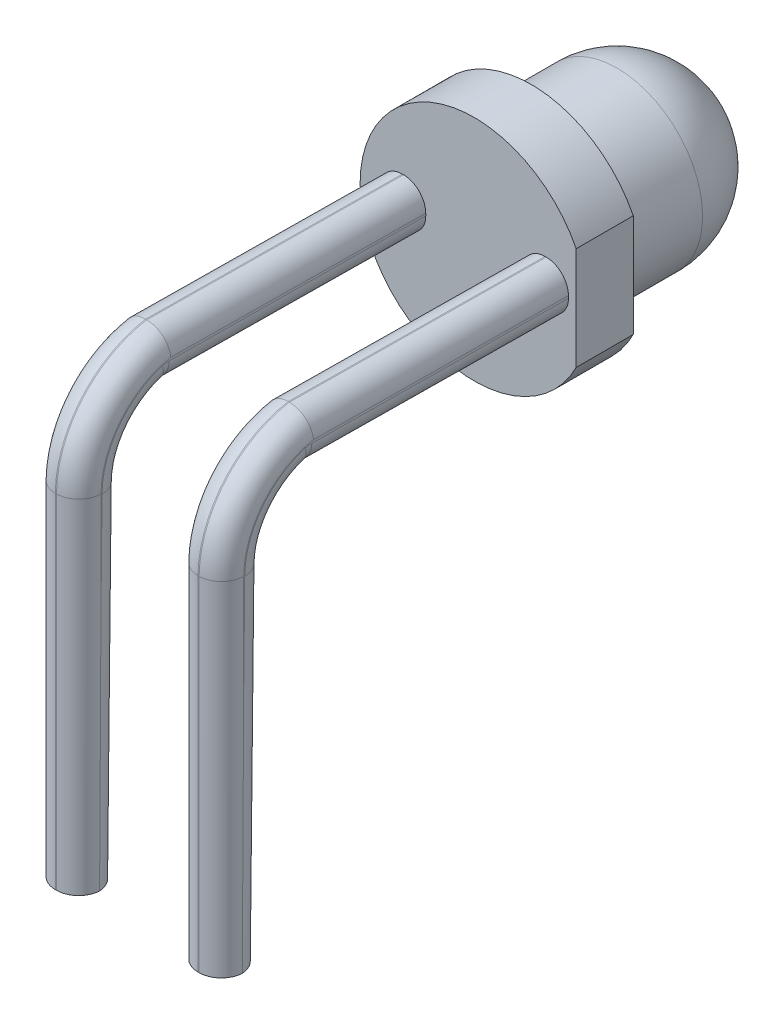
ISO-10303-21;
HEADER;
FILE_DESCRIPTION(('STEP AP214'),'2;1');
FILE_NAME('part.step','',(''),(''),'','','');
FILE_SCHEMA(('AUTOMOTIVE_DESIGN { 1 0 10303 214 1 1 1 1 }'));
ENDSEC;
DATA;
#1=APPLICATION_CONTEXT('core data for automotive mechanical design processes');
#2=APPLICATION_PROTOCOL_DEFINITION('international standard','automotive_design',2000,#1);
#3=PRODUCT_CONTEXT('',#1,'mechanical');
#4=PRODUCT('Part','Part','',(#3));
#5=PRODUCT_RELATED_PRODUCT_CATEGORY('part','',(#4));
#6=PRODUCT_DEFINITION_FORMATION('','',#4);
#7=PRODUCT_DEFINITION_CONTEXT('part definition',#1,'design');
#8=PRODUCT_DEFINITION('design','',#6,#7);
#9=PRODUCT_DEFINITION_SHAPE('','',#8);
#10=(LENGTH_UNIT() NAMED_UNIT(*) SI_UNIT(.MILLI.,.METRE.));
#11=(NAMED_UNIT(*) PLANE_ANGLE_UNIT() SI_UNIT($,.RADIAN.));
#12=(NAMED_UNIT(*) SI_UNIT($,.STERADIAN.) SOLID_ANGLE_UNIT());
#13=UNCERTAINTY_MEASURE_WITH_UNIT(LENGTH_MEASURE(1.E-05),#10,'distance_accuracy_value','');
#14=(GEOMETRIC_REPRESENTATION_CONTEXT(3) GLOBAL_UNCERTAINTY_ASSIGNED_CONTEXT((#13)) GLOBAL_UNIT_ASSIGNED_CONTEXT((#10,
#11,#12)) REPRESENTATION_CONTEXT('',''));
#15=CARTESIAN_POINT('',(0.,0.,0.));
#16=DIRECTION('',(0.,0.,1.));
#17=DIRECTION('',(1.,0.,0.));
#18=AXIS2_PLACEMENT_3D('',#15,#16,#17);
#19=CARTESIAN_POINT('',(1.65,-1.31398905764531,8.18085132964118));
#20=DIRECTION('',(-1.,0.,0.));
#21=DIRECTION('',(0.,0.,1.));
#22=AXIS2_PLACEMENT_3D('',#19,#20,#21);
#23=CYLINDRICAL_SURFACE('',#22,1.10000032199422);
#24=DIRECTION('',(-1.,0.,0.));
#25=VECTOR('',#24,1.);
#26=CARTESIAN_POINT('',(1.65,-0.261304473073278,8.5));
#27=LINE('',#26,#25);
#28=CARTESIAN_POINT('',(-1.24,-0.261304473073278,8.5));
#29=VERTEX_POINT('',#28);
#30=CARTESIAN_POINT('',(-1.26,-0.261304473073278,8.5));
#31=VERTEX_POINT('',#30);
#32=EDGE_CURVE('E612',#29,#31,#27,.T.);
#33=ORIENTED_EDGE('',*,*,#32,.F.);
#34=CARTESIAN_POINT('',(-1.24,-1.31398905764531,8.18085132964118));
#35=DIRECTION('',(1.,0.,0.));
#36=DIRECTION('',(0.,0.,-1.));
#37=AXIS2_PLACEMENT_3D('',#34,#35,#36);
#38=CIRCLE('',#37,1.10000032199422);
#39=CARTESIAN_POINT('',(-1.24,-1.30648262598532,9.28082603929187));
#40=VERTEX_POINT('',#39);
#41=EDGE_CURVE('E398',#29,#40,#38,.T.);
#42=ORIENTED_EDGE('',*,*,#41,.T.);
#43=DIRECTION('',(-1.,0.,0.));
#44=VECTOR('',#43,1.);
#45=CARTESIAN_POINT('',(1.65,-1.30648262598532,9.28082603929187));
#46=LINE('',#45,#44);
#47=CARTESIAN_POINT('',(-1.26,-1.30648262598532,9.28082603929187));
#48=VERTEX_POINT('',#47);
#49=EDGE_CURVE('E446',#40,#48,#46,.T.);
#50=ORIENTED_EDGE('',*,*,#49,.T.);
#51=CARTESIAN_POINT('',(-1.26,-1.31398905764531,8.18085132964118));
#52=DIRECTION('',(1.,0.,0.));
#53=DIRECTION('',(0.,0.,-1.));
#54=AXIS2_PLACEMENT_3D('',#51,#52,#53);
#55=CIRCLE('',#54,1.10000032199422);
#56=EDGE_CURVE('E396',#48,#31,#55,.F.);
#57=ORIENTED_EDGE('',*,*,#56,.T.);
#58=EDGE_LOOP('',(#33,#42,#50,#57));
#59=FACE_BOUND('',#58,.T.);
#60=ADVANCED_FACE('F27',(#59),#23,.F.);
#61=CARTESIAN_POINT('',(1.26,-1.30648262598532,9.28082603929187));
#62=VERTEX_POINT('',#61);
#63=CARTESIAN_POINT('',(1.24,-1.30648262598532,9.28082603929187));
#64=VERTEX_POINT('',#63);
#65=EDGE_CURVE('E594',#62,#64,#46,.T.);
#66=ORIENTED_EDGE('',*,*,#65,.T.);
#67=CARTESIAN_POINT('',(1.24,-1.31398905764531,8.18085132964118));
#68=DIRECTION('',(-1.,0.,0.));
#69=DIRECTION('',(0.,0.,1.));
#70=AXIS2_PLACEMENT_3D('',#67,#68,#69);
#71=CIRCLE('',#70,1.10000032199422);
#72=CARTESIAN_POINT('',(1.24,-0.261304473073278,8.5));
#73=VERTEX_POINT('',#72);
#74=EDGE_CURVE('E334',#64,#73,#71,.T.);
#75=ORIENTED_EDGE('',*,*,#74,.T.);
#76=CARTESIAN_POINT('',(1.26,-0.261304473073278,8.5));
#77=VERTEX_POINT('',#76);
#78=EDGE_CURVE('E266',#77,#73,#27,.T.);
#79=ORIENTED_EDGE('',*,*,#78,.F.);
#80=CARTESIAN_POINT('',(1.26,-1.31398905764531,8.18085132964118));
#81=DIRECTION('',(1.,0.,0.));
#82=DIRECTION('',(0.,0.,-1.));
#83=AXIS2_PLACEMENT_3D('',#80,#81,#82);
#84=CIRCLE('',#83,1.10000032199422);
#85=EDGE_CURVE('E332',#77,#62,#84,.T.);
#86=ORIENTED_EDGE('',*,*,#85,.T.);
#87=EDGE_LOOP('',(#66,#75,#79,#86));
#88=FACE_BOUND('',#87,.T.);
#89=ADVANCED_FACE('F527',(#88),#23,.F.);
#90=CARTESIAN_POINT('',(1.65,-0.310065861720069,4.));
#91=DIRECTION('',(0.,0.999941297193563,-0.010835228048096));
#92=DIRECTION('',(0.,0.010835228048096,0.999941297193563));
#93=AXIS2_PLACEMENT_3D('',#90,#91,#92);
#94=PLANE('',#93);
#95=ORIENTED_EDGE('',*,*,#32,.T.);
#96=DIRECTION('',(0.,-0.010835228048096,-0.999941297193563));
#97=VECTOR('',#96,1.);
#98=CARTESIAN_POINT('',(-1.26,-0.310065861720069,4.));
#99=LINE('',#98,#97);
#100=CARTESIAN_POINT('',(-1.26,-0.310065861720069,4.));
#101=VERTEX_POINT('',#100);
#102=EDGE_CURVE('E342',#31,#101,#99,.T.);
#103=ORIENTED_EDGE('',*,*,#102,.T.);
#104=DIRECTION('',(-1.,0.,0.));
#105=VECTOR('',#104,1.);
#106=CARTESIAN_POINT('',(1.65,-0.310065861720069,4.));
#107=LINE('',#106,#105);
#108=CARTESIAN_POINT('',(-1.24,-0.310065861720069,4.));
#109=VERTEX_POINT('',#108);
#110=EDGE_CURVE('E609',#109,#101,#107,.T.);
#111=ORIENTED_EDGE('',*,*,#110,.F.);
#112=DIRECTION('',(0.,-0.010835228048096,-0.999941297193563));
#113=VECTOR('',#112,1.);
#114=CARTESIAN_POINT('',(-1.24,-0.261304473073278,8.5));
#115=LINE('',#114,#113);
#116=EDGE_CURVE('E340',#109,#29,#115,.F.);
#117=ORIENTED_EDGE('',*,*,#116,.T.);
#118=EDGE_LOOP('',(#95,#103,#111,#117));
#119=FACE_BOUND('',#118,.T.);
#120=ADVANCED_FACE('F534',(#119),#94,.F.);
#121=ORIENTED_EDGE('',*,*,#78,.T.);
#122=DIRECTION('',(0.,0.010835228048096,0.999941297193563));
#123=VECTOR('',#122,1.);
#124=CARTESIAN_POINT('',(1.24,-0.310065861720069,4.));
#125=LINE('',#124,#123);
#126=CARTESIAN_POINT('',(1.24,-0.310065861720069,4.));
#127=VERTEX_POINT('',#126);
#128=EDGE_CURVE('E338',#73,#127,#125,.F.);
#129=ORIENTED_EDGE('',*,*,#128,.T.);
#130=CARTESIAN_POINT('',(1.26,-0.310065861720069,4.));
#131=VERTEX_POINT('',#130);
#132=EDGE_CURVE('E611',#131,#127,#107,.T.);
#133=ORIENTED_EDGE('',*,*,#132,.F.);
#134=DIRECTION('',(0.,-0.010835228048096,-0.999941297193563));
#135=VECTOR('',#134,1.);
#136=CARTESIAN_POINT('',(1.26,-0.261304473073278,8.5));
#137=LINE('',#136,#135);
#138=EDGE_CURVE('E336',#131,#77,#137,.F.);
#139=ORIENTED_EDGE('',*,*,#138,.T.);
#140=EDGE_LOOP('',(#121,#129,#133,#139));
#141=FACE_BOUND('',#140,.T.);
#142=ADVANCED_FACE('F717',(#141),#94,.F.);
#143=CARTESIAN_POINT('',(1.65,0.510253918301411,4.));
#144=DIRECTION('',(0.,-0.999941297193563,0.0108352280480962));
#145=DIRECTION('',(0.,-0.0108352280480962,-0.999941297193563));
#146=AXIS2_PLACEMENT_3D('',#143,#144,#145);
#147=PLANE('',#146);
#148=DIRECTION('',(-1.,0.,0.));
#149=VECTOR('',#148,1.);
#150=CARTESIAN_POINT('',(1.65,0.510253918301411,4.));
#151=LINE('',#150,#149);
#152=CARTESIAN_POINT('',(-1.24,0.510253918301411,4.));
#153=VERTEX_POINT('',#152);
#154=CARTESIAN_POINT('',(-1.26,0.510253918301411,4.));
#155=VERTEX_POINT('',#154);
#156=EDGE_CURVE('E558',#153,#155,#151,.T.);
#157=ORIENTED_EDGE('',*,*,#156,.T.);
#158=DIRECTION('',(0.,0.0108352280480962,0.999941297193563));
#159=VECTOR('',#158,1.);
#160=CARTESIAN_POINT('',(-1.26,0.510253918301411,4.));
#161=LINE('',#160,#159);
#162=CARTESIAN_POINT('',(-1.26,0.559015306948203,8.5));
#163=VERTEX_POINT('',#162);
#164=EDGE_CURVE('E314',#155,#163,#161,.T.);
#165=ORIENTED_EDGE('',*,*,#164,.T.);
#166=DIRECTION('',(-1.,0.,0.));
#167=VECTOR('',#166,1.);
#168=CARTESIAN_POINT('',(1.65,0.559015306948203,8.5));
#169=LINE('',#168,#167);
#170=CARTESIAN_POINT('',(-1.24,0.559015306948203,8.5));
#171=VERTEX_POINT('',#170);
#172=EDGE_CURVE('E606',#171,#163,#169,.T.);
#173=ORIENTED_EDGE('',*,*,#172,.F.);
#174=DIRECTION('',(0.,0.0108352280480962,0.999941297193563));
#175=VECTOR('',#174,1.);
#176=CARTESIAN_POINT('',(-1.24,0.510253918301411,4.));
#177=LINE('',#176,#175);
#178=EDGE_CURVE('E312',#171,#153,#177,.F.);
#179=ORIENTED_EDGE('',*,*,#178,.T.);
#180=EDGE_LOOP('',(#157,#165,#173,#179));
#181=FACE_BOUND('',#180,.T.);
#182=ADVANCED_FACE('F715',(#181),#147,.F.);
#183=CARTESIAN_POINT('',(1.26,0.510253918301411,4.));
#184=VERTEX_POINT('',#183);
#185=CARTESIAN_POINT('',(1.24,0.510253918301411,4.));
#186=VERTEX_POINT('',#185);
#187=EDGE_CURVE('E438',#184,#186,#151,.T.);
#188=ORIENTED_EDGE('',*,*,#187,.T.);
#189=DIRECTION('',(0.,-0.0108352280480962,-0.999941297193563));
#190=VECTOR('',#189,1.);
#191=CARTESIAN_POINT('',(1.24,0.559015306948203,8.49999999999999));
#192=LINE('',#191,#190);
#193=CARTESIAN_POINT('',(1.24,0.559015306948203,8.5));
#194=VERTEX_POINT('',#193);
#195=EDGE_CURVE('E310',#186,#194,#192,.F.);
#196=ORIENTED_EDGE('',*,*,#195,.T.);
#197=CARTESIAN_POINT('',(1.26,0.559015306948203,8.5));
#198=VERTEX_POINT('',#197);
#199=EDGE_CURVE('E566',#198,#194,#169,.T.);
#200=ORIENTED_EDGE('',*,*,#199,.F.);
#201=DIRECTION('',(0.,0.0108352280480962,0.999941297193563));
#202=VECTOR('',#201,1.);
#203=CARTESIAN_POINT('',(1.26,0.510253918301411,4.));
#204=LINE('',#203,#202);
#205=EDGE_CURVE('E308',#198,#184,#204,.F.);
#206=ORIENTED_EDGE('',*,*,#205,.T.);
#207=EDGE_LOOP('',(#188,#196,#200,#206));
#208=FACE_BOUND('',#207,.T.);
#209=ADVANCED_FACE('F633',(#208),#147,.F.);
#210=CARTESIAN_POINT('',(1.65,-1.31398905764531,8.18085132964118));
#211=DIRECTION('',(-1.,0.,0.));
#212=DIRECTION('',(0.,0.,1.));
#213=AXIS2_PLACEMENT_3D('',#210,#211,#212);
#214=CYLINDRICAL_SURFACE('',#213,1.90000032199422);
#215=DIRECTION('',(-1.,0.,0.));
#216=VECTOR('',#215,1.);
#217=CARTESIAN_POINT('',(1.65,-1.29076804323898,10.0807097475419));
#218=LINE('',#217,#216);
#219=CARTESIAN_POINT('',(-1.24,-1.29076804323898,10.0807097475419));
#220=VERTEX_POINT('',#219);
#221=CARTESIAN_POINT('',(-1.26,-1.29076804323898,10.0807097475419));
#222=VERTEX_POINT('',#221);
#223=EDGE_CURVE('E602',#220,#222,#218,.T.);
#224=ORIENTED_EDGE('',*,*,#223,.F.);
#225=CARTESIAN_POINT('',(-1.24,-1.31398905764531,8.18085132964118));
#226=DIRECTION('',(1.,0.,0.));
#227=DIRECTION('',(0.,0.,-1.));
#228=AXIS2_PLACEMENT_3D('',#225,#226,#227);
#229=CIRCLE('',#228,1.90000032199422);
#230=EDGE_CURVE('E402',#220,#171,#229,.F.);
#231=ORIENTED_EDGE('',*,*,#230,.T.);
#232=ORIENTED_EDGE('',*,*,#172,.T.);
#233=CARTESIAN_POINT('',(-1.26,-1.31398905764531,8.18085132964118));
#234=DIRECTION('',(1.,0.,0.));
#235=DIRECTION('',(0.,0.,-1.));
#236=AXIS2_PLACEMENT_3D('',#233,#234,#235);
#237=CIRCLE('',#236,1.90000032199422);
#238=EDGE_CURVE('E400',#163,#222,#237,.T.);
#239=ORIENTED_EDGE('',*,*,#238,.T.);
#240=EDGE_LOOP('',(#224,#231,#232,#239));
#241=FACE_BOUND('',#240,.T.);
#242=ADVANCED_FACE('F712',(#241),#214,.T.);
#243=CARTESIAN_POINT('',(1.26,-1.29076804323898,10.0807097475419));
#244=VERTEX_POINT('',#243);
#245=CARTESIAN_POINT('',(1.24,-1.29076804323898,10.0807097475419));
#246=VERTEX_POINT('',#245);
#247=EDGE_CURVE('E605',#244,#246,#218,.T.);
#248=ORIENTED_EDGE('',*,*,#247,.F.);
#249=CARTESIAN_POINT('',(1.26,-1.31398905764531,8.18085132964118));
#250=DIRECTION('',(1.,0.,0.));
#251=DIRECTION('',(0.,0.,-1.));
#252=AXIS2_PLACEMENT_3D('',#249,#250,#251);
#253=CIRCLE('',#252,1.90000032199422);
#254=EDGE_CURVE('E378',#244,#198,#253,.F.);
#255=ORIENTED_EDGE('',*,*,#254,.T.);
#256=ORIENTED_EDGE('',*,*,#199,.T.);
#257=CARTESIAN_POINT('',(1.24,-1.31398905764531,8.18085132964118));
#258=DIRECTION('',(-1.,0.,0.));
#259=DIRECTION('',(0.,0.,1.));
#260=AXIS2_PLACEMENT_3D('',#257,#258,#259);
#261=CIRCLE('',#260,1.90000032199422);
#262=EDGE_CURVE('E376',#194,#246,#261,.F.);
#263=ORIENTED_EDGE('',*,*,#262,.T.);
#264=EDGE_LOOP('',(#248,#255,#256,#263));
#265=FACE_BOUND('',#264,.T.);
#266=ADVANCED_FACE('F710',(#265),#214,.T.);
#267=CARTESIAN_POINT('',(1.65,-7.3061304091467,10.0807097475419));
#268=DIRECTION('',(0.,0.,-1.));
#269=DIRECTION('',(0.,1.,0.));
#270=AXIS2_PLACEMENT_3D('',#267,#268,#269);
#271=PLANE('',#270);
#272=ORIENTED_EDGE('',*,*,#223,.T.);
#273=DIRECTION('',(0.,-1.,0.));
#274=VECTOR('',#273,1.);
#275=CARTESIAN_POINT('',(-1.26,-7.3061304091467,10.0807097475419));
#276=LINE('',#275,#274);
#277=CARTESIAN_POINT('',(-1.26,-7.3061304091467,10.0807097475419));
#278=VERTEX_POINT('',#277);
#279=EDGE_CURVE('E416',#222,#278,#276,.T.);
#280=ORIENTED_EDGE('',*,*,#279,.T.);
#281=DIRECTION('',(-1.,0.,0.));
#282=VECTOR('',#281,1.);
#283=CARTESIAN_POINT('',(1.65,-7.3061304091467,10.0807097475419));
#284=LINE('',#283,#282);
#285=CARTESIAN_POINT('',(-1.24,-7.3061304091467,10.0807097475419));
#286=VERTEX_POINT('',#285);
#287=EDGE_CURVE('E599',#286,#278,#284,.T.);
#288=ORIENTED_EDGE('',*,*,#287,.F.);
#289=DIRECTION('',(0.,-1.,0.));
#290=VECTOR('',#289,1.);
#291=CARTESIAN_POINT('',(-1.24,-1.29076804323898,10.0807097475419));
#292=LINE('',#291,#290);
#293=EDGE_CURVE('E414',#286,#220,#292,.F.);
#294=ORIENTED_EDGE('',*,*,#293,.T.);
#295=EDGE_LOOP('',(#272,#280,#288,#294));
#296=FACE_BOUND('',#295,.T.);
#297=ADVANCED_FACE('F707',(#296),#271,.F.);
#298=CARTESIAN_POINT('',(1.26,-7.3061304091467,10.0807097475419));
#299=VERTEX_POINT('',#298);
#300=CARTESIAN_POINT('',(1.24,-7.3061304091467,10.0807097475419));
#301=VERTEX_POINT('',#300);
#302=EDGE_CURVE('E601',#299,#301,#284,.T.);
#303=ORIENTED_EDGE('',*,*,#302,.F.);
#304=DIRECTION('',(0.,-1.,0.));
#305=VECTOR('',#304,1.);
#306=CARTESIAN_POINT('',(1.26,-1.29076804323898,10.0807097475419));
#307=LINE('',#306,#305);
#308=EDGE_CURVE('E374',#299,#244,#307,.F.);
#309=ORIENTED_EDGE('',*,*,#308,.T.);
#310=ORIENTED_EDGE('',*,*,#247,.T.);
#311=DIRECTION('',(0.,1.,0.));
#312=VECTOR('',#311,1.);
#313=CARTESIAN_POINT('',(1.24,-7.3061304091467,10.0807097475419));
#314=LINE('',#313,#312);
#315=EDGE_CURVE('E372',#246,#301,#314,.F.);
#316=ORIENTED_EDGE('',*,*,#315,.T.);
#317=EDGE_LOOP('',(#303,#309,#310,#316));
#318=FACE_BOUND('',#317,.T.);
#319=ADVANCED_FACE('F706',(#318),#271,.F.);
#320=CARTESIAN_POINT('',(1.65,-7.3061304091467,9.34583740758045));
#321=DIRECTION('',(0.,1.,0.));
#322=DIRECTION('',(0.,0.,1.));
#323=AXIS2_PLACEMENT_3D('',#320,#321,#322);
#324=PLANE('',#323);
#325=CARTESIAN_POINT('',(-1.26,-7.3061304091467,9.69070974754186));
#326=DIRECTION('',(0.,1.,0.));
#327=DIRECTION('',(0.,0.,1.));
#328=AXIS2_PLACEMENT_3D('',#325,#326,#327);
#329=CIRCLE('',#328,0.39);
#330=CARTESIAN_POINT('',(-1.64934610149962,-7.3061304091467,9.71328436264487));
#331=VERTEX_POINT('',#330);
#332=EDGE_CURVE('E42',#278,#331,#329,.F.);
#333=ORIENTED_EDGE('',*,*,#332,.T.);
#334=CARTESIAN_POINT('',(-1.26,-7.3061304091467,9.73586030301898));
#335=DIRECTION('',(0.,1.,0.));
#336=DIRECTION('',(0.,0.,-1.));
#337=AXIS2_PLACEMENT_3D('',#334,#335,#336);
#338=ELLIPSE('',#337,0.390022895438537,0.39);
#339=CARTESIAN_POINT('',(-1.26,-7.3061304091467,9.34583740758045));
#340=VERTEX_POINT('',#339);
#341=EDGE_CURVE('E412',#331,#340,#338,.F.);
#342=ORIENTED_EDGE('',*,*,#341,.T.);
#343=DIRECTION('',(-1.,0.,0.));
#344=VECTOR('',#343,1.);
#345=CARTESIAN_POINT('',(1.65,-7.3061304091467,9.34583740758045));
#346=LINE('',#345,#344);
#347=CARTESIAN_POINT('',(-1.24,-7.3061304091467,9.34583740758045));
#348=VERTEX_POINT('',#347);
#349=EDGE_CURVE('E595',#348,#340,#346,.T.);
#350=ORIENTED_EDGE('',*,*,#349,.F.);
#351=CARTESIAN_POINT('',(-1.24,-7.3061304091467,9.73586030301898));
#352=DIRECTION('',(0.,1.,0.));
#353=DIRECTION('',(0.,0.,1.));
#354=AXIS2_PLACEMENT_3D('',#351,#352,#353);
#355=ELLIPSE('',#354,0.390022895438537,0.39);
#356=CARTESIAN_POINT('',(-0.850653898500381,-7.3061304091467,9.71328436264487));
#357=VERTEX_POINT('',#356);
#358=EDGE_CURVE('E49',#348,#357,#355,.F.);
#359=ORIENTED_EDGE('',*,*,#358,.T.);
#360=CARTESIAN_POINT('',(-1.24,-7.3061304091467,9.69070974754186));
#361=DIRECTION('',(0.,1.,0.));
#362=DIRECTION('',(0.,0.,1.));
#363=AXIS2_PLACEMENT_3D('',#360,#361,#362);
#364=CIRCLE('',#363,0.39);
#365=EDGE_CURVE('E408',#357,#286,#364,.F.);
#366=ORIENTED_EDGE('',*,*,#365,.T.);
#367=ORIENTED_EDGE('',*,*,#287,.T.);
#368=EDGE_LOOP('',(#333,#342,#350,#359,#366,#367));
#369=FACE_BOUND('',#368,.T.);
#370=ADVANCED_FACE('F703',(#369),#324,.F.);
#371=CARTESIAN_POINT('',(1.26,-7.3061304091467,9.34583740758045));
#372=VERTEX_POINT('',#371);
#373=CARTESIAN_POINT('',(1.24,-7.3061304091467,9.34583740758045));
#374=VERTEX_POINT('',#373);
#375=EDGE_CURVE('E598',#372,#374,#346,.T.);
#376=ORIENTED_EDGE('',*,*,#375,.F.);
#377=CARTESIAN_POINT('',(1.26,-7.3061304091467,9.73586030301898));
#378=DIRECTION('',(0.,1.,0.));
#379=DIRECTION('',(0.,0.,1.));
#380=AXIS2_PLACEMENT_3D('',#377,#378,#379);
#381=ELLIPSE('',#380,0.390022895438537,0.39);
#382=CARTESIAN_POINT('',(1.64934610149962,-7.3061304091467,9.71328436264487));
#383=VERTEX_POINT('',#382);
#384=EDGE_CURVE('E370',#372,#383,#381,.F.);
#385=ORIENTED_EDGE('',*,*,#384,.T.);
#386=CARTESIAN_POINT('',(1.26,-7.3061304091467,9.69070974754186));
#387=DIRECTION('',(0.,1.,0.));
#388=DIRECTION('',(0.,0.,1.));
#389=AXIS2_PLACEMENT_3D('',#386,#387,#388);
#390=CIRCLE('',#389,0.39);
#391=EDGE_CURVE('E368',#383,#299,#390,.F.);
#392=ORIENTED_EDGE('',*,*,#391,.T.);
#393=ORIENTED_EDGE('',*,*,#302,.T.);
#394=CARTESIAN_POINT('',(1.24,-7.3061304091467,9.69070974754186));
#395=DIRECTION('',(0.,1.,0.));
#396=DIRECTION('',(0.,0.,1.));
#397=AXIS2_PLACEMENT_3D('',#394,#395,#396);
#398=CIRCLE('',#397,0.39);
#399=CARTESIAN_POINT('',(0.850653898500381,-7.3061304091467,9.71328436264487));
#400=VERTEX_POINT('',#399);
#401=EDGE_CURVE('E364',#301,#400,#398,.F.);
#402=ORIENTED_EDGE('',*,*,#401,.T.);
#403=CARTESIAN_POINT('',(1.24,-7.3061304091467,9.73586030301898));
#404=DIRECTION('',(0.,1.,0.));
#405=DIRECTION('',(0.,0.,-1.));
#406=AXIS2_PLACEMENT_3D('',#403,#404,#405);
#407=ELLIPSE('',#406,0.390022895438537,0.39);
#408=EDGE_CURVE('E366',#400,#374,#407,.F.);
#409=ORIENTED_EDGE('',*,*,#408,.T.);
#410=EDGE_LOOP('',(#376,#385,#392,#393,#402,#409));
#411=FACE_BOUND('',#410,.T.);
#412=ADVANCED_FACE('F701',(#411),#324,.F.);
#413=CARTESIAN_POINT('',(1.65,-1.30648262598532,9.28082603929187));
#414=DIRECTION('',(0.,0.0108352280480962,0.999941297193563));
#415=DIRECTION('',(0.,-0.999941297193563,0.0108352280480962));
#416=AXIS2_PLACEMENT_3D('',#413,#414,#415);
#417=PLANE('',#416);
#418=ORIENTED_EDGE('',*,*,#49,.F.);
#419=DIRECTION('',(0.,0.999941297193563,-0.0108352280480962));
#420=VECTOR('',#419,1.);
#421=CARTESIAN_POINT('',(-1.24,-7.30613040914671,9.34583740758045));
#422=LINE('',#421,#420);
#423=EDGE_CURVE('E406',#40,#348,#422,.F.);
#424=ORIENTED_EDGE('',*,*,#423,.T.);
#425=ORIENTED_EDGE('',*,*,#349,.T.);
#426=DIRECTION('',(0.,0.999941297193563,-0.0108352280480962));
#427=VECTOR('',#426,1.);
#428=CARTESIAN_POINT('',(-1.26,-1.30648262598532,9.28082603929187));
#429=LINE('',#428,#427);
#430=EDGE_CURVE('E404',#340,#48,#429,.T.);
#431=ORIENTED_EDGE('',*,*,#430,.T.);
#432=EDGE_LOOP('',(#418,#424,#425,#431));
#433=FACE_BOUND('',#432,.T.);
#434=ADVANCED_FACE('F697',(#433),#417,.F.);
#435=ORIENTED_EDGE('',*,*,#65,.F.);
#436=DIRECTION('',(0.,0.999941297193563,-0.0108352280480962));
#437=VECTOR('',#436,1.);
#438=CARTESIAN_POINT('',(1.26,-7.30613040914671,9.34583740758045));
#439=LINE('',#438,#437);
#440=EDGE_CURVE('E362',#62,#372,#439,.F.);
#441=ORIENTED_EDGE('',*,*,#440,.T.);
#442=ORIENTED_EDGE('',*,*,#375,.T.);
#443=DIRECTION('',(0.,-0.999941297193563,0.0108352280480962));
#444=VECTOR('',#443,1.);
#445=CARTESIAN_POINT('',(1.24,-1.30648262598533,9.28082603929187));
#446=LINE('',#445,#444);
#447=EDGE_CURVE('E360',#374,#64,#446,.F.);
#448=ORIENTED_EDGE('',*,*,#447,.T.);
#449=EDGE_LOOP('',(#435,#441,#442,#448));
#450=FACE_BOUND('',#449,.T.);
#451=ADVANCED_FACE('F700',(#450),#417,.F.);
#452=CARTESIAN_POINT('',(0.,0.,4.));
#453=DIRECTION('',(0.,0.,-1.));
#454=DIRECTION('',(-1.,0.,0.));
#455=AXIS2_PLACEMENT_3D('',#452,#453,#454);
#456=CYLINDRICAL_SURFACE('',#455,1.5);
#457=CARTESIAN_POINT('',(0.,0.,1.5));
#458=DIRECTION('',(0.,0.,-1.));
#459=DIRECTION('',(-1.,0.,0.));
#460=AXIS2_PLACEMENT_3D('',#457,#458,#459);
#461=CIRCLE('',#460,1.5);
#462=CARTESIAN_POINT('',(-1.5,0.,1.5));
#463=VERTEX_POINT('',#462);
#464=EDGE_CURVE('E289',#463,#463,#461,.F.);
#465=ORIENTED_EDGE('',*,*,#464,.T.);
#466=EDGE_LOOP('',(#465));
#467=FACE_BOUND('',#466,.T.);
#468=CARTESIAN_POINT('',(0.,0.,3.));
#469=DIRECTION('',(0.,0.,1.));
#470=DIRECTION('',(1.,0.,0.));
#471=AXIS2_PLACEMENT_3D('',#468,#469,#470);
#472=CIRCLE('',#471,1.5);
#473=CARTESIAN_POINT('',(1.5,0.,3.));
#474=VERTEX_POINT('',#473);
#475=EDGE_CURVE('E285',#474,#474,#472,.T.);
#476=ORIENTED_EDGE('',*,*,#475,.F.);
#477=EDGE_LOOP('',(#476));
#478=FACE_BOUND('',#477,.T.);
#479=ADVANCED_FACE('F29',(#467,#478),#456,.T.);
#480=CARTESIAN_POINT('',(0.,0.,3.));
#481=DIRECTION('',(0.,0.,1.));
#482=DIRECTION('',(1.,0.,0.));
#483=AXIS2_PLACEMENT_3D('',#480,#481,#482);
#484=PLANE('',#483);
#485=CARTESIAN_POINT('',(0.,0.,3.));
#486=DIRECTION('',(0.,0.,1.));
#487=DIRECTION('',(1.,0.,0.));
#488=AXIS2_PLACEMENT_3D('',#485,#486,#487);
#489=CIRCLE('',#488,2.);
#490=CARTESIAN_POINT('',(1.78571428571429,0.900680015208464,3.));
#491=VERTEX_POINT('',#490);
#492=CARTESIAN_POINT('',(1.78571428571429,-0.900680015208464,3.));
#493=VERTEX_POINT('',#492);
#494=EDGE_CURVE('E272',#491,#493,#489,.T.);
#495=ORIENTED_EDGE('',*,*,#494,.F.);
#496=DIRECTION('',(0.,1.,0.));
#497=VECTOR('',#496,1.);
#498=CARTESIAN_POINT('',(1.78571428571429,0.900680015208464,3.));
#499=LINE('',#498,#497);
#500=EDGE_CURVE('E277',#493,#491,#499,.T.);
#501=ORIENTED_EDGE('',*,*,#500,.F.);
#502=EDGE_LOOP('',(#495,#501));
#503=FACE_BOUND('',#502,.T.);
#504=ORIENTED_EDGE('',*,*,#475,.T.);
#505=EDGE_LOOP('',(#504));
#506=FACE_BOUND('',#505,.T.);
#507=ADVANCED_FACE('F544',(#503,#506),#484,.F.);
#508=CARTESIAN_POINT('',(0.,0.,3.));
#509=DIRECTION('',(0.,0.,1.));
#510=DIRECTION('',(1.,0.,0.));
#511=AXIS2_PLACEMENT_3D('',#508,#509,#510);
#512=CYLINDRICAL_SURFACE('',#511,2.);
#513=CARTESIAN_POINT('',(0.,0.,4.));
#514=DIRECTION('',(0.,0.,1.));
#515=DIRECTION('',(1.,0.,0.));
#516=AXIS2_PLACEMENT_3D('',#513,#514,#515);
#517=CIRCLE('',#516,2.);
#518=CARTESIAN_POINT('',(1.78571428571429,0.900680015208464,4.));
#519=VERTEX_POINT('',#518);
#520=CARTESIAN_POINT('',(1.78571428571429,-0.900680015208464,4.));
#521=VERTEX_POINT('',#520);
#522=EDGE_CURVE('E260',#519,#521,#517,.T.);
#523=ORIENTED_EDGE('',*,*,#522,.F.);
#524=DIRECTION('',(0.,0.,1.));
#525=VECTOR('',#524,1.);
#526=CARTESIAN_POINT('',(1.78571428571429,0.900680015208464,3.));
#527=LINE('',#526,#525);
#528=EDGE_CURVE('E276',#491,#519,#527,.T.);
#529=ORIENTED_EDGE('',*,*,#528,.F.);
#530=ORIENTED_EDGE('',*,*,#494,.T.);
#531=DIRECTION('',(0.,0.,1.));
#532=VECTOR('',#531,1.);
#533=CARTESIAN_POINT('',(1.78571428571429,-0.900680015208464,3.));
#534=LINE('',#533,#532);
#535=EDGE_CURVE('E269',#493,#521,#534,.T.);
#536=ORIENTED_EDGE('',*,*,#535,.T.);
#537=EDGE_LOOP('',(#523,#529,#530,#536));
#538=FACE_BOUND('',#537,.T.);
#539=ADVANCED_FACE('F270',(#538),#512,.T.);
#540=CARTESIAN_POINT('',(1.78571428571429,0.900680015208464,3.));
#541=DIRECTION('',(1.,0.,0.));
#542=DIRECTION('',(0.,0.,-1.));
#543=AXIS2_PLACEMENT_3D('',#540,#541,#542);
#544=PLANE('',#543);
#545=DIRECTION('',(0.,1.,0.));
#546=VECTOR('',#545,1.);
#547=CARTESIAN_POINT('',(1.78571428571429,0.900680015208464,4.));
#548=LINE('',#547,#546);
#549=EDGE_CURVE('E264',#521,#519,#548,.T.);
#550=ORIENTED_EDGE('',*,*,#549,.F.);
#551=ORIENTED_EDGE('',*,*,#535,.F.);
#552=ORIENTED_EDGE('',*,*,#500,.T.);
#553=ORIENTED_EDGE('',*,*,#528,.T.);
#554=EDGE_LOOP('',(#550,#551,#552,#553));
#555=FACE_BOUND('',#554,.T.);
#556=ADVANCED_FACE('F279',(#555),#544,.T.);
#557=CARTESIAN_POINT('',(0.,0.,4.));
#558=DIRECTION('',(0.,0.,1.));
#559=DIRECTION('',(1.,0.,0.));
#560=AXIS2_PLACEMENT_3D('',#557,#558,#559);
#561=PLANE('',#560);
#562=ORIENTED_EDGE('',*,*,#156,.F.);
#563=CARTESIAN_POINT('',(-1.24,0.120231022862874,4.));
#564=DIRECTION('',(0.,0.,1.));
#565=DIRECTION('',(0.,-1.,0.));
#566=AXIS2_PLACEMENT_3D('',#563,#564,#565);
#567=ELLIPSE('',#566,0.390022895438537,0.39);
#568=CARTESIAN_POINT('',(-0.85,0.120231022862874,4.));
#569=VERTEX_POINT('',#568);
#570=EDGE_CURVE('E426',#153,#569,#567,.F.);
#571=ORIENTED_EDGE('',*,*,#570,.T.);
#572=DIRECTION('',(0.,-1.,0.));
#573=VECTOR('',#572,1.);
#574=CARTESIAN_POINT('',(-0.85,0.623900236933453,4.));
#575=LINE('',#574,#573);
#576=CARTESIAN_POINT('',(-0.85,0.0799570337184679,4.));
#577=VERTEX_POINT('',#576);
#578=EDGE_CURVE('E578',#569,#577,#575,.T.);
#579=ORIENTED_EDGE('',*,*,#578,.T.);
#580=CARTESIAN_POINT('',(-1.24,0.0799570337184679,4.));
#581=DIRECTION('',(0.,0.,1.));
#582=DIRECTION('',(0.,1.,0.));
#583=AXIS2_PLACEMENT_3D('',#580,#581,#582);
#584=ELLIPSE('',#583,0.390022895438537,0.39);
#585=EDGE_CURVE('E428',#577,#109,#584,.F.);
#586=ORIENTED_EDGE('',*,*,#585,.T.);
#587=ORIENTED_EDGE('',*,*,#110,.T.);
#588=CARTESIAN_POINT('',(-1.26,0.0799570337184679,4.));
#589=DIRECTION('',(0.,0.,1.));
#590=DIRECTION('',(0.,-1.,0.));
#591=AXIS2_PLACEMENT_3D('',#588,#589,#590);
#592=ELLIPSE('',#591,0.390022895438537,0.39);
#593=CARTESIAN_POINT('',(-1.65,0.0799570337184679,4.));
#594=VERTEX_POINT('',#593);
#595=EDGE_CURVE('E424',#101,#594,#592,.F.);
#596=ORIENTED_EDGE('',*,*,#595,.T.);
#597=DIRECTION('',(0.,1.,0.));
#598=VECTOR('',#597,1.);
#599=CARTESIAN_POINT('',(-1.65,-0.310065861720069,4.));
#600=LINE('',#599,#598);
#601=CARTESIAN_POINT('',(-1.65,0.120231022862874,4.));
#602=VERTEX_POINT('',#601);
#603=EDGE_CURVE('E447',#594,#602,#600,.T.);
#604=ORIENTED_EDGE('',*,*,#603,.T.);
#605=CARTESIAN_POINT('',(-1.26,0.120231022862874,4.));
#606=DIRECTION('',(0.,0.,1.));
#607=DIRECTION('',(0.,1.,0.));
#608=AXIS2_PLACEMENT_3D('',#605,#606,#607);
#609=ELLIPSE('',#608,0.390022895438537,0.39);
#610=EDGE_CURVE('E420',#602,#155,#609,.F.);
#611=ORIENTED_EDGE('',*,*,#610,.T.);
#612=EDGE_LOOP('',(#562,#571,#579,#586,#587,#596,#604,#611));
#613=FACE_BOUND('',#612,.T.);
#614=ORIENTED_EDGE('',*,*,#132,.T.);
#615=CARTESIAN_POINT('',(1.24,0.0799570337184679,4.));
#616=DIRECTION('',(0.,0.,1.));
#617=DIRECTION('',(0.,-1.,0.));
#618=AXIS2_PLACEMENT_3D('',#615,#616,#617);
#619=ELLIPSE('',#618,0.390022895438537,0.39);
#620=CARTESIAN_POINT('',(0.85,0.0799570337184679,4.));
#621=VERTEX_POINT('',#620);
#622=EDGE_CURVE('E422',#127,#621,#619,.F.);
#623=ORIENTED_EDGE('',*,*,#622,.T.);
#624=DIRECTION('',(0.,1.,0.));
#625=VECTOR('',#624,1.);
#626=CARTESIAN_POINT('',(0.85,0.623900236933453,4.));
#627=LINE('',#626,#625);
#628=CARTESIAN_POINT('',(0.85,0.120231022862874,4.));
#629=VERTEX_POINT('',#628);
#630=EDGE_CURVE('E581',#621,#629,#627,.T.);
#631=ORIENTED_EDGE('',*,*,#630,.T.);
#632=CARTESIAN_POINT('',(1.24,0.120231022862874,4.));
#633=DIRECTION('',(0.,0.,1.));
#634=DIRECTION('',(0.,1.,0.));
#635=AXIS2_PLACEMENT_3D('',#632,#633,#634);
#636=ELLIPSE('',#635,0.390022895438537,0.39);
#637=EDGE_CURVE('E418',#629,#186,#636,.F.);
#638=ORIENTED_EDGE('',*,*,#637,.T.);
#639=ORIENTED_EDGE('',*,*,#187,.F.);
#640=CARTESIAN_POINT('',(1.26,0.120231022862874,4.));
#641=DIRECTION('',(0.,0.,1.));
#642=DIRECTION('',(0.,-1.,0.));
#643=AXIS2_PLACEMENT_3D('',#640,#641,#642);
#644=ELLIPSE('',#643,0.390022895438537,0.39);
#645=CARTESIAN_POINT('',(1.65,0.120231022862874,4.));
#646=VERTEX_POINT('',#645);
#647=EDGE_CURVE('E35',#184,#646,#644,.F.);
#648=ORIENTED_EDGE('',*,*,#647,.T.);
#649=DIRECTION('',(0.,1.,0.));
#650=VECTOR('',#649,1.);
#651=CARTESIAN_POINT('',(1.65,-0.310065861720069,4.));
#652=LINE('',#651,#650);
#653=CARTESIAN_POINT('',(1.65,0.0799570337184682,4.));
#654=VERTEX_POINT('',#653);
#655=EDGE_CURVE('E435',#654,#646,#652,.T.);
#656=ORIENTED_EDGE('',*,*,#655,.F.);
#657=CARTESIAN_POINT('',(1.26,0.0799570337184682,4.));
#658=DIRECTION('',(0.,0.,1.));
#659=DIRECTION('',(0.,1.,0.));
#660=AXIS2_PLACEMENT_3D('',#657,#658,#659);
#661=ELLIPSE('',#660,0.390022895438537,0.39);
#662=EDGE_CURVE('E11',#654,#131,#661,.F.);
#663=ORIENTED_EDGE('',*,*,#662,.T.);
#664=EDGE_LOOP('',(#614,#623,#631,#638,#639,#648,#656,#663));
#665=FACE_BOUND('',#664,.T.);
#666=ORIENTED_EDGE('',*,*,#522,.T.);
#667=ORIENTED_EDGE('',*,*,#549,.T.);
#668=EDGE_LOOP('',(#666,#667));
#669=FACE_BOUND('',#668,.T.);
#670=ADVANCED_FACE('F262',(#613,#665,#669),#561,.T.);
#671=CARTESIAN_POINT('',(0.,0.,1.5));
#672=DIRECTION('',(0.,0.,1.));
#673=DIRECTION('',(1.,0.,0.));
#674=AXIS2_PLACEMENT_3D('',#671,#672,#673);
#675=SPHERICAL_SURFACE('',#674,1.5);
#676=ORIENTED_EDGE('',*,*,#464,.F.);
#677=EDGE_LOOP('',(#676));
#678=FACE_BOUND('',#677,.T.);
#679=ADVANCED_FACE('F540',(#678),#675,.T.);
#680=CARTESIAN_POINT('',(1.65,-1.31398905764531,8.18085132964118));
#681=DIRECTION('',(1.,0.,0.));
#682=DIRECTION('',(0.,0.,-1.));
#683=AXIS2_PLACEMENT_3D('',#680,#681,#682);
#684=PLANE('',#683);
#685=ORIENTED_EDGE('',*,*,#655,.T.);
#686=DIRECTION('',(0.,0.0108352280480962,0.999941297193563));
#687=VECTOR('',#686,1.);
#688=CARTESIAN_POINT('',(1.65,0.169038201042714,8.50422573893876));
#689=LINE('',#688,#687);
#690=CARTESIAN_POINT('',(1.65,0.168635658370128,8.46707663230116));
#691=VERTEX_POINT('',#690);
#692=EDGE_CURVE('E358',#646,#691,#689,.T.);
#693=ORIENTED_EDGE('',*,*,#692,.T.);
#694=CARTESIAN_POINT('',(1.65,-1.31398905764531,8.18085132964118));
#695=DIRECTION('',(1.,0.,0.));
#696=DIRECTION('',(0.,0.,-1.));
#697=AXIS2_PLACEMENT_3D('',#694,#695,#696);
#698=CIRCLE('',#697,1.51000032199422);
#699=CARTESIAN_POINT('',(1.65,-1.2932880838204,9.69070974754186));
#700=VERTEX_POINT('',#699);
#701=EDGE_CURVE('E356',#691,#700,#698,.T.);
#702=ORIENTED_EDGE('',*,*,#701,.T.);
#703=DIRECTION('',(0.,-1.,0.));
#704=VECTOR('',#703,1.);
#705=CARTESIAN_POINT('',(1.65,-7.3061304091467,9.69070974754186));
#706=LINE('',#705,#704);
#707=CARTESIAN_POINT('',(1.65,-3.13936023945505,9.69070974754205));
#708=VERTEX_POINT('',#707);
#709=EDGE_CURVE('E354',#700,#708,#706,.T.);
#710=ORIENTED_EDGE('',*,*,#709,.T.);
#711=DIRECTION('',(0.,0.999941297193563,-0.0108352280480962));
#712=VECTOR('',#711,1.);
#713=CARTESIAN_POINT('',(1.65,-1.30225688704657,9.67080314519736));
#714=LINE('',#713,#712);
#715=CARTESIAN_POINT('',(1.65,-1.3022568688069,9.67080546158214));
#716=VERTEX_POINT('',#715);
#717=EDGE_CURVE('E351',#708,#716,#714,.T.);
#718=ORIENTED_EDGE('',*,*,#717,.T.);
#719=CARTESIAN_POINT('',(1.65,-1.31398905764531,8.18085132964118));
#720=DIRECTION('',(1.,0.,0.));
#721=DIRECTION('',(0.,0.,-1.));
#722=AXIS2_PLACEMENT_3D('',#719,#720,#721);
#723=CIRCLE('',#722,1.49000032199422);
#724=CARTESIAN_POINT('',(1.65,0.111919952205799,8.61315267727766));
#725=VERTEX_POINT('',#724);
#726=EDGE_CURVE('E349',#716,#725,#723,.F.);
#727=ORIENTED_EDGE('',*,*,#726,.T.);
#728=CARTESIAN_POINT('',(1.65,-0.261304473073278,8.5));
#729=DIRECTION('',(1.,0.,0.));
#730=DIRECTION('',(0.,0.,-1.));
#731=AXIS2_PLACEMENT_3D('',#728,#729,#730);
#732=CIRCLE('',#731,0.39);
#733=CARTESIAN_POINT('',(1.65,0.128672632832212,8.49577426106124));
#734=VERTEX_POINT('',#733);
#735=EDGE_CURVE('E346',#734,#725,#732,.T.);
#736=ORIENTED_EDGE('',*,*,#735,.F.);
#737=DIRECTION('',(0.,-0.010835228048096,-0.999941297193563));
#738=VECTOR('',#737,1.);
#739=CARTESIAN_POINT('',(1.65,0.0799112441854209,3.99577426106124));
#740=LINE('',#739,#738);
#741=EDGE_CURVE('E344',#734,#654,#740,.T.);
#742=ORIENTED_EDGE('',*,*,#741,.T.);
#743=EDGE_LOOP('',(#685,#693,#702,#710,#718,#727,#736,#742));
#744=FACE_BOUND('',#743,.T.);
#745=ADVANCED_FACE('F443',(#744),#684,.T.);
#746=CARTESIAN_POINT('',(-1.65,-1.31398905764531,8.18085132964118));
#747=DIRECTION('',(1.,0.,0.));
#748=DIRECTION('',(0.,0.,-1.));
#749=AXIS2_PLACEMENT_3D('',#746,#747,#748);
#750=PLANE('',#749);
#751=CARTESIAN_POINT('',(-1.65,-1.31398905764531,8.18085132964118));
#752=DIRECTION('',(1.,0.,0.));
#753=DIRECTION('',(0.,0.,-1.));
#754=AXIS2_PLACEMENT_3D('',#751,#752,#753);
#755=CIRCLE('',#754,1.51000032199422);
#756=CARTESIAN_POINT('',(-1.65,-1.2932880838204,9.69070974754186));
#757=VERTEX_POINT('',#756);
#758=CARTESIAN_POINT('',(-1.65,0.168635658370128,8.46707663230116));
#759=VERTEX_POINT('',#758);
#760=EDGE_CURVE('E323',#757,#759,#755,.F.);
#761=ORIENTED_EDGE('',*,*,#760,.T.);
#762=DIRECTION('',(0.,0.0108352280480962,0.999941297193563));
#763=VECTOR('',#762,1.);
#764=CARTESIAN_POINT('',(-1.65,0.165360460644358,8.1648212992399));
#765=LINE('',#764,#763);
#766=EDGE_CURVE('E330',#759,#602,#765,.F.);
#767=ORIENTED_EDGE('',*,*,#766,.T.);
#768=ORIENTED_EDGE('',*,*,#603,.F.);
#769=DIRECTION('',(0.,-0.010835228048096,-0.999941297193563));
#770=VECTOR('',#769,1.);
#771=CARTESIAN_POINT('',(-1.65,0.125091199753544,8.16525765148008));
#772=LINE('',#771,#770);
#773=CARTESIAN_POINT('',(-1.65,0.128672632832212,8.49577426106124));
#774=VERTEX_POINT('',#773);
#775=EDGE_CURVE('E328',#594,#774,#772,.F.);
#776=ORIENTED_EDGE('',*,*,#775,.T.);
#777=CARTESIAN_POINT('',(-1.65,-0.261304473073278,8.5));
#778=DIRECTION('',(1.,0.,0.));
#779=DIRECTION('',(0.,0.,-1.));
#780=AXIS2_PLACEMENT_3D('',#777,#778,#779);
#781=CIRCLE('',#780,0.39);
#782=CARTESIAN_POINT('',(-1.65,0.111919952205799,8.61315267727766));
#783=VERTEX_POINT('',#782);
#784=EDGE_CURVE('E325',#783,#774,#781,.F.);
#785=ORIENTED_EDGE('',*,*,#784,.F.);
#786=CARTESIAN_POINT('',(-1.65,-1.31398905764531,8.18085132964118));
#787=DIRECTION('',(1.,0.,0.));
#788=DIRECTION('',(0.,0.,-1.));
#789=AXIS2_PLACEMENT_3D('',#786,#787,#788);
#790=CIRCLE('',#789,1.49000032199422);
#791=CARTESIAN_POINT('',(-1.65,-1.3038212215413,9.67082009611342));
#792=VERTEX_POINT('',#791);
#793=EDGE_CURVE('E321',#783,#792,#790,.T.);
#794=ORIENTED_EDGE('',*,*,#793,.T.);
#795=DIRECTION('',(0.,0.999941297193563,-0.0108352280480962));
#796=VECTOR('',#795,1.);
#797=CARTESIAN_POINT('',(-1.65,-1.29784466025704,9.6707553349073));
#798=LINE('',#797,#796);
#799=CARTESIAN_POINT('',(-1.65,-3.13936023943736,9.69070974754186));
#800=VERTEX_POINT('',#799);
#801=EDGE_CURVE('E319',#792,#800,#798,.F.);
#802=ORIENTED_EDGE('',*,*,#801,.T.);
#803=DIRECTION('',(0.,-1.,0.));
#804=VECTOR('',#803,1.);
#805=CARTESIAN_POINT('',(-1.65,-1.31398905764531,9.69070974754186));
#806=LINE('',#805,#804);
#807=EDGE_CURVE('E317',#800,#757,#806,.F.);
#808=ORIENTED_EDGE('',*,*,#807,.T.);
#809=EDGE_LOOP('',(#761,#767,#768,#776,#785,#794,#802,#808));
#810=FACE_BOUND('',#809,.T.);
#811=ADVANCED_FACE('F692',(#810),#750,.F.);
#812=CARTESIAN_POINT('',(-0.85,0.623900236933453,14.));
#813=DIRECTION('',(1.,0.,0.));
#814=DIRECTION('',(0.,0.,-1.));
#815=AXIS2_PLACEMENT_3D('',#812,#813,#814);
#816=PLANE('',#815);
#817=CARTESIAN_POINT('',(-0.85,-0.261304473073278,8.5));
#818=DIRECTION('',(1.,0.,0.));
#819=DIRECTION('',(0.,0.,-1.));
#820=AXIS2_PLACEMENT_3D('',#817,#818,#819);
#821=CIRCLE('',#820,0.39);
#822=CARTESIAN_POINT('',(-0.85,0.128672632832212,8.49577426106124));
#823=VERTEX_POINT('',#822);
#824=CARTESIAN_POINT('',(-0.85,0.111919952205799,8.61315267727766));
#825=VERTEX_POINT('',#824);
#826=EDGE_CURVE('E391',#823,#825,#821,.T.);
#827=ORIENTED_EDGE('',*,*,#826,.F.);
#828=DIRECTION('',(0.,-0.010835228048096,-0.999941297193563));
#829=VECTOR('',#828,1.);
#830=CARTESIAN_POINT('',(-0.85,0.0799112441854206,3.99577426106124));
#831=LINE('',#830,#829);
#832=EDGE_CURVE('E394',#823,#577,#831,.T.);
#833=ORIENTED_EDGE('',*,*,#832,.T.);
#834=ORIENTED_EDGE('',*,*,#578,.F.);
#835=DIRECTION('',(0.,0.0108352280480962,0.999941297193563));
#836=VECTOR('',#835,1.);
#837=CARTESIAN_POINT('',(-0.85,0.169038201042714,8.50422573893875));
#838=LINE('',#837,#836);
#839=CARTESIAN_POINT('',(-0.85,0.168635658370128,8.46707663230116));
#840=VERTEX_POINT('',#839);
#841=EDGE_CURVE('E388',#569,#840,#838,.T.);
#842=ORIENTED_EDGE('',*,*,#841,.T.);
#843=CARTESIAN_POINT('',(-0.85,-1.31398905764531,8.18085132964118));
#844=DIRECTION('',(1.,0.,0.));
#845=DIRECTION('',(0.,0.,-1.));
#846=AXIS2_PLACEMENT_3D('',#843,#844,#845);
#847=CIRCLE('',#846,1.51000032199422);
#848=CARTESIAN_POINT('',(-0.85,-1.29328808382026,9.69070974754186));
#849=VERTEX_POINT('',#848);
#850=EDGE_CURVE('E384',#840,#849,#847,.T.);
#851=ORIENTED_EDGE('',*,*,#850,.T.);
#852=DIRECTION('',(0.,-1.,0.));
#853=VECTOR('',#852,1.);
#854=CARTESIAN_POINT('',(-0.85,-7.3061304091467,9.69070974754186));
#855=LINE('',#854,#853);
#856=CARTESIAN_POINT('',(-0.85,-3.13936023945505,9.69070974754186));
#857=VERTEX_POINT('',#856);
#858=EDGE_CURVE('E380',#849,#857,#855,.T.);
#859=ORIENTED_EDGE('',*,*,#858,.T.);
#860=DIRECTION('',(0.,0.999941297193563,-0.0108352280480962));
#861=VECTOR('',#860,1.);
#862=CARTESIAN_POINT('',(-0.85,-1.30225688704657,9.67080314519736));
#863=LINE('',#862,#861);
#864=CARTESIAN_POINT('',(-0.85,-1.3038212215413,9.67082009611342));
#865=VERTEX_POINT('',#864);
#866=EDGE_CURVE('E382',#857,#865,#863,.T.);
#867=ORIENTED_EDGE('',*,*,#866,.T.);
#868=CARTESIAN_POINT('',(-0.85,-1.31398905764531,8.18085132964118));
#869=DIRECTION('',(1.,0.,0.));
#870=DIRECTION('',(0.,0.,-1.));
#871=AXIS2_PLACEMENT_3D('',#868,#869,#870);
#872=CIRCLE('',#871,1.49000032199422);
#873=EDGE_CURVE('E386',#865,#825,#872,.F.);
#874=ORIENTED_EDGE('',*,*,#873,.T.);
#875=EDGE_LOOP('',(#827,#833,#834,#842,#851,#859,#867,#874));
#876=FACE_BOUND('',#875,.T.);
#877=ADVANCED_FACE('F576',(#876),#816,.T.);
#878=CARTESIAN_POINT('',(0.85,0.623900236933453,14.));
#879=DIRECTION('',(-1.,0.,0.));
#880=DIRECTION('',(0.,0.,1.));
#881=AXIS2_PLACEMENT_3D('',#878,#879,#880);
#882=PLANE('',#881);
#883=ORIENTED_EDGE('',*,*,#630,.F.);
#884=DIRECTION('',(0.,0.010835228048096,0.999941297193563));
#885=VECTOR('',#884,1.);
#886=CARTESIAN_POINT('',(0.85,0.128672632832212,8.49577426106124));
#887=LINE('',#886,#885);
#888=CARTESIAN_POINT('',(0.85,0.128672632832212,8.49577426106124));
#889=VERTEX_POINT('',#888);
#890=EDGE_CURVE('E306',#621,#889,#887,.T.);
#891=ORIENTED_EDGE('',*,*,#890,.T.);
#892=CARTESIAN_POINT('',(0.85,-0.261304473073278,8.5));
#893=DIRECTION('',(-1.,0.,0.));
#894=DIRECTION('',(0.,0.,1.));
#895=AXIS2_PLACEMENT_3D('',#892,#893,#894);
#896=CIRCLE('',#895,0.39);
#897=CARTESIAN_POINT('',(0.85,0.111919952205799,8.61315267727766));
#898=VERTEX_POINT('',#897);
#899=EDGE_CURVE('E303',#898,#889,#896,.T.);
#900=ORIENTED_EDGE('',*,*,#899,.F.);
#901=CARTESIAN_POINT('',(0.85,-1.31398905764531,8.18085132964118));
#902=DIRECTION('',(-1.,0.,0.));
#903=DIRECTION('',(0.,0.,1.));
#904=AXIS2_PLACEMENT_3D('',#901,#902,#903);
#905=CIRCLE('',#904,1.49000032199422);
#906=CARTESIAN_POINT('',(0.85,-1.3038212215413,9.67082009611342));
#907=VERTEX_POINT('',#906);
#908=EDGE_CURVE('E298',#898,#907,#905,.F.);
#909=ORIENTED_EDGE('',*,*,#908,.T.);
#910=DIRECTION('',(0.,-0.999941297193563,0.0108352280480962));
#911=VECTOR('',#910,1.);
#912=CARTESIAN_POINT('',(0.85,-7.30190467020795,9.73581451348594));
#913=LINE('',#912,#911);
#914=CARTESIAN_POINT('',(0.85,-3.13936023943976,9.69070974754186));
#915=VERTEX_POINT('',#914);
#916=EDGE_CURVE('E294',#907,#915,#913,.T.);
#917=ORIENTED_EDGE('',*,*,#916,.T.);
#918=DIRECTION('',(0.,1.,0.));
#919=VECTOR('',#918,1.);
#920=CARTESIAN_POINT('',(0.85,-1.29076804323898,9.69070974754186));
#921=LINE('',#920,#919);
#922=CARTESIAN_POINT('',(0.85,-1.29328808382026,9.69070974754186));
#923=VERTEX_POINT('',#922);
#924=EDGE_CURVE('E292',#915,#923,#921,.T.);
#925=ORIENTED_EDGE('',*,*,#924,.T.);
#926=CARTESIAN_POINT('',(0.85,-1.31398905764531,8.18085132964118));
#927=DIRECTION('',(-1.,0.,0.));
#928=DIRECTION('',(0.,0.,1.));
#929=AXIS2_PLACEMENT_3D('',#926,#927,#928);
#930=CIRCLE('',#929,1.51000032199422);
#931=CARTESIAN_POINT('',(0.85,0.168635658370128,8.46707663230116));
#932=VERTEX_POINT('',#931);
#933=EDGE_CURVE('E296',#923,#932,#930,.T.);
#934=ORIENTED_EDGE('',*,*,#933,.T.);
#935=DIRECTION('',(0.,-0.0108352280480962,-0.999941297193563));
#936=VECTOR('',#935,1.);
#937=CARTESIAN_POINT('',(0.85,0.120276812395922,4.00422573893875));
#938=LINE('',#937,#936);
#939=EDGE_CURVE('E300',#932,#629,#938,.T.);
#940=ORIENTED_EDGE('',*,*,#939,.T.);
#941=EDGE_LOOP('',(#883,#891,#900,#909,#917,#925,#934,#940));
#942=FACE_BOUND('',#941,.T.);
#943=ADVANCED_FACE('F627',(#942),#882,.T.);
#944=CARTESIAN_POINT('',(1.24,0.188366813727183,14.0047193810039));
#945=DIRECTION('',(0.,-0.010835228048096,-0.999941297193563));
#946=DIRECTION('',(0.,0.999941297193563,-0.010835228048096));
#947=AXIS2_PLACEMENT_3D('',#944,#945,#946);
#948=CYLINDRICAL_SURFACE('',#947,0.39);
#949=CARTESIAN_POINT('',(1.24,0.128672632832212,8.49577426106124));
#950=DIRECTION('',(0.,0.0108352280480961,0.999941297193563));
#951=DIRECTION('',(0.,-0.999941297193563,0.0108352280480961));
#952=AXIS2_PLACEMENT_3D('',#949,#950,#951);
#953=CIRCLE('',#952,0.39);
#954=EDGE_CURVE('E582',#889,#73,#953,.T.);
#955=ORIENTED_EDGE('',*,*,#954,.F.);
#956=ORIENTED_EDGE('',*,*,#890,.F.);
#957=ORIENTED_EDGE('',*,*,#622,.F.);
#958=ORIENTED_EDGE('',*,*,#128,.F.);
#959=EDGE_LOOP('',(#955,#956,#957,#958));
#960=FACE_BOUND('',#959,.T.);
#961=ADVANCED_FACE('F625',(#960),#948,.T.);
#962=CARTESIAN_POINT('',(1.24,-0.261304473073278,8.5));
#963=DIRECTION('',(-1.,0.,0.));
#964=DIRECTION('',(0.,0.,1.));
#965=AXIS2_PLACEMENT_3D('',#962,#963,#964);
#966=DEGENERATE_TOROIDAL_SURFACE('',#965,0.39,0.39,.T.);
#967=ORIENTED_EDGE('',*,*,#899,.T.);
#968=ORIENTED_EDGE('',*,*,#954,.T.);
#969=CARTESIAN_POINT('',(1.24,0.111919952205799,8.61315267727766));
#970=DIRECTION('',(0.,0.29013506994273,-0.956985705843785));
#971=DIRECTION('',(0.,0.956985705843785,0.29013506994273));
#972=AXIS2_PLACEMENT_3D('',#969,#970,#971);
#973=CIRCLE('',#972,0.39);
#974=EDGE_CURVE('E587',#898,#73,#973,.F.);
#975=ORIENTED_EDGE('',*,*,#974,.F.);
#976=EDGE_LOOP('',(#967,#968,#975));
#977=FACE_BOUND('',#976,.T.);
#978=ADVANCED_FACE('F681',(#977),#966,.T.);
#979=CARTESIAN_POINT('',(1.24,-1.31398905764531,8.18085132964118));
#980=DIRECTION('',(-1.,0.,0.));
#981=DIRECTION('',(0.,0.,1.));
#982=AXIS2_PLACEMENT_3D('',#979,#980,#981);
#983=TOROIDAL_SURFACE('',#982,1.49000032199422,0.39);
#984=ORIENTED_EDGE('',*,*,#974,.T.);
#985=ORIENTED_EDGE('',*,*,#74,.F.);
#986=CARTESIAN_POINT('',(1.24,-1.30382125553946,9.67081695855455));
#987=DIRECTION('',(0.,-0.999976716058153,0.00682402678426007));
#988=DIRECTION('',(0.,-0.00682402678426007,-0.999976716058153));
#989=AXIS2_PLACEMENT_3D('',#986,#987,#988);
#990=CIRCLE('',#989,0.39);
#991=EDGE_CURVE('E733',#907,#64,#990,.T.);
#992=ORIENTED_EDGE('',*,*,#991,.F.);
#993=ORIENTED_EDGE('',*,*,#908,.F.);
#994=EDGE_LOOP('',(#984,#985,#992,#993));
#995=FACE_BOUND('',#994,.T.);
#996=ADVANCED_FACE('F677',(#995),#983,.T.);
#997=CARTESIAN_POINT('',(1.24,0.576769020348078,9.65044227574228));
#998=DIRECTION('',(0.,0.999941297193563,-0.0108352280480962));
#999=DIRECTION('',(0.,0.0108352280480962,0.999941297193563));
#1000=AXIS2_PLACEMENT_3D('',#997,#998,#999);
#1001=CYLINDRICAL_SURFACE('',#1000,0.39);
#1002=ORIENTED_EDGE('',*,*,#447,.F.);
#1003=ORIENTED_EDGE('',*,*,#408,.F.);
#1004=CARTESIAN_POINT('',(1.24,-3.13936023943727,9.69070974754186));
#1005=DIRECTION('',(0.,-0.00541769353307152,-0.999985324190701));
#1006=DIRECTION('',(0.,-0.999985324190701,0.00541769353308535));
#1007=AXIS2_PLACEMENT_3D('',#1004,#1005,#1006);
#1008=ELLIPSE('',#1007,71.9863531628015,0.39);
#1009=EDGE_CURVE('E647',#915,#400,#1008,.F.);
#1010=ORIENTED_EDGE('',*,*,#1009,.F.);
#1011=ORIENTED_EDGE('',*,*,#916,.F.);
#1012=ORIENTED_EDGE('',*,*,#991,.T.);
#1013=EDGE_LOOP('',(#1002,#1003,#1010,#1011,#1012));
#1014=FACE_BOUND('',#1013,.T.);
#1015=ADVANCED_FACE('F673',(#1014),#1001,.T.);
#1016=CARTESIAN_POINT('',(1.24,0.623900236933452,9.69070974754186));
#1017=DIRECTION('',(0.,-1.,0.));
#1018=DIRECTION('',(0.,0.,-1.));
#1019=AXIS2_PLACEMENT_3D('',#1016,#1017,#1018);
#1020=CYLINDRICAL_SURFACE('',#1019,0.39);
#1021=ORIENTED_EDGE('',*,*,#401,.F.);
#1022=ORIENTED_EDGE('',*,*,#315,.F.);
#1023=CARTESIAN_POINT('',(1.24,-1.29076804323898,10.0807097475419));
#1024=CARTESIAN_POINT('',(1.21806054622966,-1.29076796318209,10.0807283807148));
#1025=CARTESIAN_POINT('',(1.19612665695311,-1.29077935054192,10.0788595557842));
#1026=CARTESIAN_POINT('',(1.15289416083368,-1.29082446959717,10.0714841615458));
#1027=CARTESIAN_POINT('',(1.13159512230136,-1.29085818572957,10.0659801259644));
#1028=CARTESIAN_POINT('',(1.09021414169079,-1.29094739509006,10.0514675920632));
#1029=CARTESIAN_POINT('',(1.0701327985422,-1.29100289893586,10.0424573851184));
#1030=CARTESIAN_POINT('',(1.03177314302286,-1.29113452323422,10.0211973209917));
#1031=CARTESIAN_POINT('',(1.01349432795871,-1.29121063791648,10.0089483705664));
#1032=CARTESIAN_POINT('',(0.979254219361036,-1.2913819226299,9.98155734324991));
#1033=CARTESIAN_POINT('',(0.96329266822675,-1.29147709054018,9.96641558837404));
#1034=CARTESIAN_POINT('',(0.93412979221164,-1.29168452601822,9.93365929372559));
#1035=CARTESIAN_POINT('',(0.920929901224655,-1.29179680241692,9.91604347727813));
#1036=CARTESIAN_POINT('',(0.897668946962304,-1.29203601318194,9.87883522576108));
#1037=CARTESIAN_POINT('',(0.887609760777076,-1.29216295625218,9.85924161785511));
#1038=CARTESIAN_POINT('',(0.870940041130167,-1.29242832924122,9.81867343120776));
#1039=CARTESIAN_POINT('',(0.864323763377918,-1.29256673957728,9.79770121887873));
#1040=CARTESIAN_POINT('',(0.855667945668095,-1.29282324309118,9.75923637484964));
#1041=CARTESIAN_POINT('',(0.852977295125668,-1.29293985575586,9.74188777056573));
#1042=CARTESIAN_POINT('',(0.850486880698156,-1.29313417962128,9.71322404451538));
#1043=CARTESIAN_POINT('',(0.849998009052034,-1.29321091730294,9.7019659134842));
#1044=CARTESIAN_POINT('',(0.85,-1.29328808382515,9.69070974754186));
#1045=B_SPLINE_CURVE_WITH_KNOTS('',3,(#1023,#1024,#1025,#1026,#1027,#1028,#1029,#1030,#1031,
#1032,#1033,#1034,#1035,#1036,#1037,#1038,#1039,#1040,#1041,#1042,#1043,#1044),.UNSPECIFIED.,
.F.,.F.,(4,2,2,2,2,2,2,2,2,2,4),(0.,0.0657309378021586,0.131416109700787,0.197133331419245,
0.262832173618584,0.328523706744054,0.394249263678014,0.460014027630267,0.525668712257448,
0.578178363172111,0.61194304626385),.UNSPECIFIED.);
#1046=EDGE_CURVE('E643',#923,#246,#1045,.F.);
#1047=ORIENTED_EDGE('',*,*,#1046,.F.);
#1048=ORIENTED_EDGE('',*,*,#924,.F.);
#1049=ORIENTED_EDGE('',*,*,#1009,.T.);
#1050=EDGE_LOOP('',(#1021,#1022,#1047,#1048,#1049));
#1051=FACE_BOUND('',#1050,.T.);
#1052=ADVANCED_FACE('F669',(#1051),#1020,.T.);
#1053=CARTESIAN_POINT('',(1.24,-1.31398905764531,8.18085132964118));
#1054=DIRECTION('',(-1.,0.,0.));
#1055=DIRECTION('',(0.,0.,1.));
#1056=AXIS2_PLACEMENT_3D('',#1053,#1054,#1055);
#1057=TOROIDAL_SURFACE('',#1056,1.51000032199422,0.39);
#1058=ORIENTED_EDGE('',*,*,#1046,.T.);
#1059=ORIENTED_EDGE('',*,*,#262,.F.);
#1060=CARTESIAN_POINT('',(1.24,0.559015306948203,8.5));
#1061=CARTESIAN_POINT('',(1.21812610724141,0.559034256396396,8.50000100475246));
#1062=CARTESIAN_POINT('',(1.19625825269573,0.557174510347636,8.49985432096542));
#1063=CARTESIAN_POINT('',(1.15315955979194,0.549837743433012,8.49927303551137));
#1064=CARTESIAN_POINT('',(1.13192821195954,0.544363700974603,8.49883867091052));
#1065=CARTESIAN_POINT('',(1.0906803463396,0.529934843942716,8.49768920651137));
#1066=CARTESIAN_POINT('',(1.0706643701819,0.520978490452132,8.49697398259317));
#1067=CARTESIAN_POINT('',(1.03242560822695,0.499852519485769,8.49527728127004));
#1068=CARTESIAN_POINT('',(1.01420244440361,0.48768358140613,8.49429586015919));
#1069=CARTESIAN_POINT('',(0.980027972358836,0.460458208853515,8.49208439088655));
#1070=CARTESIAN_POINT('',(0.964080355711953,0.445397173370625,8.49085394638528));
#1071=CARTESIAN_POINT('',(0.934931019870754,0.412825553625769,8.48817011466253));
#1072=CARTESIAN_POINT('',(0.92173028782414,0.395314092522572,8.48671664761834));
#1073=CARTESIAN_POINT('',(0.89839826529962,0.3582698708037,8.48361177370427));
#1074=CARTESIAN_POINT('',(0.888279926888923,0.338729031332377,8.48195957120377));
#1075=CARTESIAN_POINT('',(0.871471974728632,0.298248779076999,8.47849941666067));
#1076=CARTESIAN_POINT('',(0.8647792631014,0.277310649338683,8.47669160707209));
#1077=CARTESIAN_POINT('',(0.856928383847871,0.243086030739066,8.47370190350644));
#1078=CARTESIAN_POINT('',(0.854628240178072,0.230046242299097,8.47255503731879));
#1079=CARTESIAN_POINT('',(0.851363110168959,0.203815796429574,8.47023128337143));
#1080=CARTESIAN_POINT('',(0.85039618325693,0.190625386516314,8.46905444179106));
#1081=CARTESIAN_POINT('',(0.850032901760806,0.174497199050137,8.4676047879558));
#1082=CARTESIAN_POINT('',(0.849999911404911,0.171566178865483,8.46734090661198));
#1083=CARTESIAN_POINT('',(0.85,0.168635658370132,8.46707663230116));
#1084=B_SPLINE_CURVE_WITH_KNOTS('',3,(#1060,#1061,#1062,#1063,#1064,#1065,#1066,#1067,#1068,
#1069,#1070,#1071,#1072,#1073,#1074,#1075,#1076,#1077,#1078,#1079,#1080,#1081,#1082,#1083),
.UNSPECIFIED.,.F.,.F.,(4,2,2,2,2,2,2,2,2,2,2,4),(0.,0.0655335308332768,0.131013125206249,
0.196521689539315,0.262016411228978,0.327616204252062,0.393239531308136,0.459134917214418,
0.524970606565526,0.564784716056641,0.604540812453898,0.613369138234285),.UNSPECIFIED.);
#1085=EDGE_CURVE('E639',#932,#194,#1084,.F.);
#1086=ORIENTED_EDGE('',*,*,#1085,.F.);
#1087=ORIENTED_EDGE('',*,*,#933,.F.);
#1088=EDGE_LOOP('',(#1058,#1059,#1086,#1087));
#1089=FACE_BOUND('',#1088,.T.);
#1090=ADVANCED_FACE('F663',(#1089),#1057,.T.);
#1091=CARTESIAN_POINT('',(1.24,0.228636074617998,14.0042830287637));
#1092=DIRECTION('',(0.,0.0108352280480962,0.999941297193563));
#1093=DIRECTION('',(0.,-0.999941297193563,0.0108352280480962));
#1094=AXIS2_PLACEMENT_3D('',#1091,#1092,#1093);
#1095=CYLINDRICAL_SURFACE('',#1094,0.39);
#1096=ORIENTED_EDGE('',*,*,#1085,.T.);
#1097=ORIENTED_EDGE('',*,*,#195,.F.);
#1098=ORIENTED_EDGE('',*,*,#637,.F.);
#1099=ORIENTED_EDGE('',*,*,#939,.F.);
#1100=EDGE_LOOP('',(#1096,#1097,#1098,#1099));
#1101=FACE_BOUND('',#1100,.T.);
#1102=ADVANCED_FACE('F637',(#1101),#1095,.T.);
#1103=CARTESIAN_POINT('',(-1.26,0.0799112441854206,3.99577426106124));
#1104=DIRECTION('',(0.,-0.010835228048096,-0.999941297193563));
#1105=DIRECTION('',(0.,0.999941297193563,-0.010835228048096));
#1106=AXIS2_PLACEMENT_3D('',#1103,#1104,#1105);
#1107=CYLINDRICAL_SURFACE('',#1106,0.39);
#1108=CARTESIAN_POINT('',(-1.26,0.128672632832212,8.49577426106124));
#1109=DIRECTION('',(0.,0.0108352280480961,0.999941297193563));
#1110=DIRECTION('',(0.,-0.999941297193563,0.0108352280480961));
#1111=AXIS2_PLACEMENT_3D('',#1108,#1109,#1110);
#1112=CIRCLE('',#1111,0.39);
#1113=EDGE_CURVE('E644',#774,#31,#1112,.T.);
#1114=ORIENTED_EDGE('',*,*,#1113,.F.);
#1115=ORIENTED_EDGE('',*,*,#775,.F.);
#1116=ORIENTED_EDGE('',*,*,#595,.F.);
#1117=ORIENTED_EDGE('',*,*,#102,.F.);
#1118=EDGE_LOOP('',(#1114,#1115,#1116,#1117));
#1119=FACE_BOUND('',#1118,.T.);
#1120=ADVANCED_FACE('F668',(#1119),#1107,.T.);
#1121=CARTESIAN_POINT('',(-1.26,-0.261304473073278,8.5));
#1122=DIRECTION('',(1.,0.,0.));
#1123=DIRECTION('',(0.,0.,-1.));
#1124=AXIS2_PLACEMENT_3D('',#1121,#1122,#1123);
#1125=DEGENERATE_TOROIDAL_SURFACE('',#1124,0.39,0.39,.T.);
#1126=ORIENTED_EDGE('',*,*,#784,.T.);
#1127=ORIENTED_EDGE('',*,*,#1113,.T.);
#1128=CARTESIAN_POINT('',(-1.26,0.111919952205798,8.61315267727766));
#1129=DIRECTION('',(0.,0.29013506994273,-0.956985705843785));
#1130=DIRECTION('',(0.,0.956985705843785,0.29013506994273));
#1131=AXIS2_PLACEMENT_3D('',#1128,#1129,#1130);
#1132=CIRCLE('',#1131,0.39);
#1133=EDGE_CURVE('E650',#783,#31,#1132,.F.);
#1134=ORIENTED_EDGE('',*,*,#1133,.F.);
#1135=EDGE_LOOP('',(#1126,#1127,#1134));
#1136=FACE_BOUND('',#1135,.T.);
#1137=ADVANCED_FACE('F830',(#1136),#1125,.T.);
#1138=CARTESIAN_POINT('',(-1.26,-1.31398905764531,8.18085132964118));
#1139=DIRECTION('',(1.,0.,0.));
#1140=DIRECTION('',(0.,0.,-1.));
#1141=AXIS2_PLACEMENT_3D('',#1138,#1139,#1140);
#1142=TOROIDAL_SURFACE('',#1141,1.49000032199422,0.39);
#1143=ORIENTED_EDGE('',*,*,#1133,.T.);
#1144=ORIENTED_EDGE('',*,*,#56,.F.);
#1145=CARTESIAN_POINT('',(-1.26,-1.30382125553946,9.67081695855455));
#1146=DIRECTION('',(0.,-0.999976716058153,0.00682402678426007));
#1147=DIRECTION('',(0.,-0.00682402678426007,-0.999976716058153));
#1148=AXIS2_PLACEMENT_3D('',#1145,#1146,#1147);
#1149=CIRCLE('',#1148,0.39);
#1150=EDGE_CURVE('E999',#792,#48,#1149,.T.);
#1151=ORIENTED_EDGE('',*,*,#1150,.F.);
#1152=ORIENTED_EDGE('',*,*,#793,.F.);
#1153=EDGE_LOOP('',(#1143,#1144,#1151,#1152));
#1154=FACE_BOUND('',#1153,.T.);
#1155=ADVANCED_FACE('F837',(#1154),#1142,.T.);
#1156=CARTESIAN_POINT('',(-1.26,-1.30225688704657,9.67080314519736));
#1157=DIRECTION('',(0.,0.999941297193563,-0.0108352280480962));
#1158=DIRECTION('',(0.,0.0108352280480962,0.999941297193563));
#1159=AXIS2_PLACEMENT_3D('',#1156,#1157,#1158);
#1160=CYLINDRICAL_SURFACE('',#1159,0.39);
#1161=ORIENTED_EDGE('',*,*,#430,.F.);
#1162=ORIENTED_EDGE('',*,*,#341,.F.);
#1163=CARTESIAN_POINT('',(-1.26,-3.13936023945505,9.69070974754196));
#1164=DIRECTION('',(0.,-0.00541769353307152,-0.999985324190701));
#1165=DIRECTION('',(0.,-0.999985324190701,0.00541769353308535));
#1166=AXIS2_PLACEMENT_3D('',#1163,#1164,#1165);
#1167=ELLIPSE('',#1166,71.9863531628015,0.39);
#1168=EDGE_CURVE('E1000',#800,#331,#1167,.F.);
#1169=ORIENTED_EDGE('',*,*,#1168,.F.);
#1170=ORIENTED_EDGE('',*,*,#801,.F.);
#1171=ORIENTED_EDGE('',*,*,#1150,.T.);
#1172=EDGE_LOOP('',(#1161,#1162,#1169,#1170,#1171));
#1173=FACE_BOUND('',#1172,.T.);
#1174=ADVANCED_FACE('F845',(#1173),#1160,.T.);
#1175=CARTESIAN_POINT('',(-1.26,-7.3061304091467,9.69070974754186));
#1176=DIRECTION('',(0.,-1.,0.));
#1177=DIRECTION('',(0.,0.,-1.));
#1178=AXIS2_PLACEMENT_3D('',#1175,#1176,#1177);
#1179=CYLINDRICAL_SURFACE('',#1178,0.39);
#1180=ORIENTED_EDGE('',*,*,#332,.F.);
#1181=ORIENTED_EDGE('',*,*,#279,.F.);
#1182=CARTESIAN_POINT('',(-1.26,-1.29076804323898,10.0807097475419));
#1183=CARTESIAN_POINT('',(-1.28193945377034,-1.29076796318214,10.0807283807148));
#1184=CARTESIAN_POINT('',(-1.30387334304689,-1.290779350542,10.0788595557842));
#1185=CARTESIAN_POINT('',(-1.34710583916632,-1.29082446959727,10.0714841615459));
#1186=CARTESIAN_POINT('',(-1.36840487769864,-1.29085818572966,10.0659801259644));
#1187=CARTESIAN_POINT('',(-1.40978585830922,-1.29094739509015,10.0514675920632));
#1188=CARTESIAN_POINT('',(-1.4298672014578,-1.29100289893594,10.0424573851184));
#1189=CARTESIAN_POINT('',(-1.46822685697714,-1.2911345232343,10.0211973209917));
#1190=CARTESIAN_POINT('',(-1.4865056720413,-1.29121063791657,10.0089483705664));
#1191=CARTESIAN_POINT('',(-1.52074578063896,-1.29138192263,9.98155734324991));
#1192=CARTESIAN_POINT('',(-1.53670733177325,-1.29147709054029,9.96641558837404));
#1193=CARTESIAN_POINT('',(-1.56587020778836,-1.29168452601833,9.93365929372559));
#1194=CARTESIAN_POINT('',(-1.57907009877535,-1.29179680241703,9.91604347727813));
#1195=CARTESIAN_POINT('',(-1.6023310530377,-1.29203601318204,9.87883522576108));
#1196=CARTESIAN_POINT('',(-1.61239023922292,-1.29216295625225,9.85924161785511));
#1197=CARTESIAN_POINT('',(-1.62905995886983,-1.2924283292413,9.81867343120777));
#1198=CARTESIAN_POINT('',(-1.63567623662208,-1.29256673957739,9.79770121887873));
#1199=CARTESIAN_POINT('',(-1.6443320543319,-1.29282324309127,9.75923637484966));
#1200=CARTESIAN_POINT('',(-1.64702270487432,-1.29293985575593,9.74188777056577));
#1201=CARTESIAN_POINT('',(-1.64951311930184,-1.29313417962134,9.71322404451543));
#1202=CARTESIAN_POINT('',(-1.65000199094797,-1.293210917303,9.70196591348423));
#1203=CARTESIAN_POINT('',(-1.65,-1.29328808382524,9.69070974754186));
#1204=B_SPLINE_CURVE_WITH_KNOTS('',3,(#1182,#1183,#1184,#1185,#1186,#1187,#1188,#1189,#1190,
#1191,#1192,#1193,#1194,#1195,#1196,#1197,#1198,#1199,#1200,#1201,#1202,#1203),.UNSPECIFIED.,
.F.,.F.,(4,2,2,2,2,2,2,2,2,2,4),(0.,0.0657309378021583,0.131416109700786,0.197133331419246,
0.262832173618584,0.328523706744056,0.394249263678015,0.460014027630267,0.525668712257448,
0.578178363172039,0.61194304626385),.UNSPECIFIED.);
#1205=EDGE_CURVE('E1004',#757,#222,#1204,.F.);
#1206=ORIENTED_EDGE('',*,*,#1205,.F.);
#1207=ORIENTED_EDGE('',*,*,#807,.F.);
#1208=ORIENTED_EDGE('',*,*,#1168,.T.);
#1209=EDGE_LOOP('',(#1180,#1181,#1206,#1207,#1208));
#1210=FACE_BOUND('',#1209,.T.);
#1211=ADVANCED_FACE('F853',(#1210),#1179,.T.);
#1212=CARTESIAN_POINT('',(-1.26,-1.31398905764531,8.18085132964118));
#1213=DIRECTION('',(1.,0.,0.));
#1214=DIRECTION('',(0.,0.,-1.));
#1215=AXIS2_PLACEMENT_3D('',#1212,#1213,#1214);
#1216=TOROIDAL_SURFACE('',#1215,1.51000032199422,0.39);
#1217=ORIENTED_EDGE('',*,*,#1205,.T.);
#1218=ORIENTED_EDGE('',*,*,#238,.F.);
#1219=CARTESIAN_POINT('',(-1.26,0.559015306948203,8.5));
#1220=CARTESIAN_POINT('',(-1.28187389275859,0.559034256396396,8.50000100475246));
#1221=CARTESIAN_POINT('',(-1.30374174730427,0.557174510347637,8.49985432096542));
#1222=CARTESIAN_POINT('',(-1.34684044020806,0.549837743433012,8.49927303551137));
#1223=CARTESIAN_POINT('',(-1.36807178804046,0.544363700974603,8.49883867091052));
#1224=CARTESIAN_POINT('',(-1.4093196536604,0.529934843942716,8.49768920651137));
#1225=CARTESIAN_POINT('',(-1.4293356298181,0.520978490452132,8.49697398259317));
#1226=CARTESIAN_POINT('',(-1.46757439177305,0.49985251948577,8.49527728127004));
#1227=CARTESIAN_POINT('',(-1.48579755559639,0.48768358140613,8.49429586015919));
#1228=CARTESIAN_POINT('',(-1.51997202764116,0.460458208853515,8.49208439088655));
#1229=CARTESIAN_POINT('',(-1.53591964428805,0.445397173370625,8.49085394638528));
#1230=CARTESIAN_POINT('',(-1.56506898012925,0.41282555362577,8.48817011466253));
#1231=CARTESIAN_POINT('',(-1.57826971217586,0.395314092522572,8.48671664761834));
#1232=CARTESIAN_POINT('',(-1.60160173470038,0.3582698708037,8.48361177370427));
#1233=CARTESIAN_POINT('',(-1.61172007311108,0.338729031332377,8.48195957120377));
#1234=CARTESIAN_POINT('',(-1.62852802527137,0.298248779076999,8.47849941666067));
#1235=CARTESIAN_POINT('',(-1.6352207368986,0.277310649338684,8.47669160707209));
#1236=CARTESIAN_POINT('',(-1.64307161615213,0.243086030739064,8.47370190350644));
#1237=CARTESIAN_POINT('',(-1.64537175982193,0.230046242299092,8.4725550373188));
#1238=CARTESIAN_POINT('',(-1.64863688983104,0.203815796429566,8.47023128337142));
#1239=CARTESIAN_POINT('',(-1.64960381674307,0.190625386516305,8.46905444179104));
#1240=CARTESIAN_POINT('',(-1.64996709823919,0.174497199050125,8.46760478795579));
#1241=CARTESIAN_POINT('',(-1.65000008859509,0.17156617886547,8.46734090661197));
#1242=CARTESIAN_POINT('',(-1.65,0.168635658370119,8.46707663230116));
#1243=B_SPLINE_CURVE_WITH_KNOTS('',3,(#1219,#1220,#1221,#1222,#1223,#1224,#1225,#1226,#1227,
#1228,#1229,#1230,#1231,#1232,#1233,#1234,#1235,#1236,#1237,#1238,#1239,#1240,#1241,#1242),
.UNSPECIFIED.,.F.,.F.,(4,2,2,2,2,2,2,2,2,2,2,4),(0.,0.0655335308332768,0.131013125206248,
0.196521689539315,0.262016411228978,0.327616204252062,0.393239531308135,0.459134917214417,
0.524970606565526,0.564784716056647,0.604540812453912,0.613369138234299),.UNSPECIFIED.);
#1244=EDGE_CURVE('E455',#759,#163,#1243,.F.);
#1245=ORIENTED_EDGE('',*,*,#1244,.F.);
#1246=ORIENTED_EDGE('',*,*,#760,.F.);
#1247=EDGE_LOOP('',(#1217,#1218,#1245,#1246));
#1248=FACE_BOUND('',#1247,.T.);
#1249=ADVANCED_FACE('F861',(#1248),#1216,.T.);
#1250=CARTESIAN_POINT('',(-1.26,0.120276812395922,4.00422573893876));
#1251=DIRECTION('',(0.,0.0108352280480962,0.999941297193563));
#1252=DIRECTION('',(0.,-0.999941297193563,0.0108352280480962));
#1253=AXIS2_PLACEMENT_3D('',#1250,#1251,#1252);
#1254=CYLINDRICAL_SURFACE('',#1253,0.39);
#1255=ORIENTED_EDGE('',*,*,#610,.F.);
#1256=ORIENTED_EDGE('',*,*,#766,.F.);
#1257=ORIENTED_EDGE('',*,*,#1244,.T.);
#1258=ORIENTED_EDGE('',*,*,#164,.F.);
#1259=EDGE_LOOP('',(#1255,#1256,#1257,#1258));
#1260=FACE_BOUND('',#1259,.T.);
#1261=ADVANCED_FACE('F869',(#1260),#1254,.T.);
#1262=CARTESIAN_POINT('',(1.26,0.165360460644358,8.1648212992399));
#1263=DIRECTION('',(0.,-0.0108352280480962,-0.999941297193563));
#1264=DIRECTION('',(0.,0.999941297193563,-0.0108352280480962));
#1265=AXIS2_PLACEMENT_3D('',#1262,#1263,#1264);
#1266=CYLINDRICAL_SURFACE('',#1265,0.39);
#1267=ORIENTED_EDGE('',*,*,#647,.F.);
#1268=ORIENTED_EDGE('',*,*,#205,.F.);
#1269=CARTESIAN_POINT('',(1.26,0.559015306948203,8.5));
#1270=CARTESIAN_POINT('',(1.28187389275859,0.559034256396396,8.50000100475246));
#1271=CARTESIAN_POINT('',(1.30374174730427,0.557174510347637,8.49985432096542));
#1272=CARTESIAN_POINT('',(1.34684044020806,0.549837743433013,8.49927303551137));
#1273=CARTESIAN_POINT('',(1.36807178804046,0.544363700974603,8.49883867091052));
#1274=CARTESIAN_POINT('',(1.4093196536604,0.529934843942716,8.49768920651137));
#1275=CARTESIAN_POINT('',(1.42933562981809,0.520978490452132,8.49697398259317));
#1276=CARTESIAN_POINT('',(1.46757439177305,0.49985251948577,8.49527728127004));
#1277=CARTESIAN_POINT('',(1.48579755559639,0.48768358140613,8.49429586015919));
#1278=CARTESIAN_POINT('',(1.51997202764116,0.460458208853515,8.49208439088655));
#1279=CARTESIAN_POINT('',(1.53591964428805,0.445397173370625,8.49085394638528));
#1280=CARTESIAN_POINT('',(1.56506898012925,0.41282555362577,8.48817011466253));
#1281=CARTESIAN_POINT('',(1.57826971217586,0.395314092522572,8.48671664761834));
#1282=CARTESIAN_POINT('',(1.60160173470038,0.3582698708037,8.48361177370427));
#1283=CARTESIAN_POINT('',(1.61172007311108,0.338729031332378,8.48195957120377));
#1284=CARTESIAN_POINT('',(1.62852802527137,0.298248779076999,8.47849941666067));
#1285=CARTESIAN_POINT('',(1.6352207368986,0.277310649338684,8.47669160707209));
#1286=CARTESIAN_POINT('',(1.64307161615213,0.243086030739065,8.47370190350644));
#1287=CARTESIAN_POINT('',(1.64537175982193,0.230046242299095,8.4725550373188));
#1288=CARTESIAN_POINT('',(1.64863688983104,0.203815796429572,8.47023128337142));
#1289=CARTESIAN_POINT('',(1.64960381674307,0.190625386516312,8.46905444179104));
#1290=CARTESIAN_POINT('',(1.64996709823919,0.174497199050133,8.4676047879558));
#1291=CARTESIAN_POINT('',(1.65000008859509,0.171566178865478,8.46734090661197));
#1292=CARTESIAN_POINT('',(1.65,0.168635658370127,8.46707663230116));
#1293=B_SPLINE_CURVE_WITH_KNOTS('',3,(#1269,#1270,#1271,#1272,#1273,#1274,#1275,#1276,#1277,
#1278,#1279,#1280,#1281,#1282,#1283,#1284,#1285,#1286,#1287,#1288,#1289,#1290,#1291,#1292),
.UNSPECIFIED.,.F.,.F.,(4,2,2,2,2,2,2,2,2,2,2,4),(0.,0.0655335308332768,0.131013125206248,
0.196521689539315,0.262016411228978,0.327616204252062,0.393239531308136,0.459134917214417,
0.524970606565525,0.564784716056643,0.604540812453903,0.61336913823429),.UNSPECIFIED.);
#1294=EDGE_CURVE('E451',#691,#198,#1293,.F.);
#1295=ORIENTED_EDGE('',*,*,#1294,.F.);
#1296=ORIENTED_EDGE('',*,*,#692,.F.);
#1297=EDGE_LOOP('',(#1267,#1268,#1295,#1296));
#1298=FACE_BOUND('',#1297,.T.);
#1299=ADVANCED_FACE('F449',(#1298),#1266,.T.);
#1300=CARTESIAN_POINT('',(1.26,0.125091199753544,8.16525765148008));
#1301=DIRECTION('',(0.,0.010835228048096,0.999941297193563));
#1302=DIRECTION('',(0.,-0.999941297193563,0.010835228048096));
#1303=AXIS2_PLACEMENT_3D('',#1300,#1301,#1302);
#1304=CYLINDRICAL_SURFACE('',#1303,0.39);
#1305=ORIENTED_EDGE('',*,*,#662,.F.);
#1306=ORIENTED_EDGE('',*,*,#741,.F.);
#1307=CARTESIAN_POINT('',(1.26,0.128672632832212,8.49577426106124));
#1308=DIRECTION('',(0.,0.0108352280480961,0.999941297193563));
#1309=DIRECTION('',(0.,-0.999941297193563,0.0108352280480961));
#1310=AXIS2_PLACEMENT_3D('',#1307,#1308,#1309);
#1311=CIRCLE('',#1310,0.39);
#1312=EDGE_CURVE('E456',#77,#734,#1311,.T.);
#1313=ORIENTED_EDGE('',*,*,#1312,.F.);
#1314=ORIENTED_EDGE('',*,*,#138,.F.);
#1315=EDGE_LOOP('',(#1305,#1306,#1313,#1314));
#1316=FACE_BOUND('',#1315,.T.);
#1317=ADVANCED_FACE('F518',(#1316),#1304,.T.);
#1318=CARTESIAN_POINT('',(1.26,-1.31398905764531,8.18085132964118));
#1319=DIRECTION('',(1.,0.,0.));
#1320=DIRECTION('',(0.,0.,-1.));
#1321=AXIS2_PLACEMENT_3D('',#1318,#1319,#1320);
#1322=TOROIDAL_SURFACE('',#1321,1.51000032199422,0.39);
#1323=ORIENTED_EDGE('',*,*,#1294,.T.);
#1324=ORIENTED_EDGE('',*,*,#254,.F.);
#1325=CARTESIAN_POINT('',(1.26,-1.29076804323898,10.0807097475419));
#1326=CARTESIAN_POINT('',(1.28193945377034,-1.29076796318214,10.0807283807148));
#1327=CARTESIAN_POINT('',(1.30387334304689,-1.29077935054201,10.0788595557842));
#1328=CARTESIAN_POINT('',(1.34710583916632,-1.29082446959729,10.0714841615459));
#1329=CARTESIAN_POINT('',(1.36840487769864,-1.29085818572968,10.0659801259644));
#1330=CARTESIAN_POINT('',(1.40978585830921,-1.29094739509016,10.0514675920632));
#1331=CARTESIAN_POINT('',(1.4298672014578,-1.29100289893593,10.0424573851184));
#1332=CARTESIAN_POINT('',(1.46822685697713,-1.29113452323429,10.0211973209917));
#1333=CARTESIAN_POINT('',(1.48650567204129,-1.29121063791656,10.0089483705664));
#1334=CARTESIAN_POINT('',(1.52074578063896,-1.29138192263,9.98155734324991));
#1335=CARTESIAN_POINT('',(1.53670733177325,-1.29147709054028,9.96641558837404));
#1336=CARTESIAN_POINT('',(1.56587020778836,-1.29168452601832,9.93365929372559));
#1337=CARTESIAN_POINT('',(1.57907009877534,-1.29179680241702,9.91604347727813));
#1338=CARTESIAN_POINT('',(1.6023310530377,-1.29203601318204,9.87883522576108));
#1339=CARTESIAN_POINT('',(1.61239023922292,-1.29216295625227,9.85924161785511));
#1340=CARTESIAN_POINT('',(1.62905995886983,-1.29242832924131,9.81867343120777));
#1341=CARTESIAN_POINT('',(1.63567623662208,-1.29256673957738,9.79770121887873));
#1342=CARTESIAN_POINT('',(1.6443320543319,-1.29282324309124,9.75923637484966));
#1343=CARTESIAN_POINT('',(1.64702270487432,-1.29293985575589,9.74188777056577));
#1344=CARTESIAN_POINT('',(1.64951311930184,-1.29313417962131,9.71322404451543));
#1345=CARTESIAN_POINT('',(1.65000199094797,-1.29321091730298,9.70196591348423));
#1346=CARTESIAN_POINT('',(1.65,-1.29328808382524,9.69070974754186));
#1347=B_SPLINE_CURVE_WITH_KNOTS('',3,(#1325,#1326,#1327,#1328,#1329,#1330,#1331,#1332,#1333,
#1334,#1335,#1336,#1337,#1338,#1339,#1340,#1341,#1342,#1343,#1344,#1345,#1346),.UNSPECIFIED.,
.F.,.F.,(4,2,2,2,2,2,2,2,2,2,4),(0.,0.0657309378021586,0.131416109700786,0.197133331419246,
0.262832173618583,0.328523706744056,0.394249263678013,0.460014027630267,0.525668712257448,
0.578178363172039,0.61194304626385),.UNSPECIFIED.);
#1348=EDGE_CURVE('E461',#700,#244,#1347,.F.);
#1349=ORIENTED_EDGE('',*,*,#1348,.F.);
#1350=ORIENTED_EDGE('',*,*,#701,.F.);
#1351=EDGE_LOOP('',(#1323,#1324,#1349,#1350));
#1352=FACE_BOUND('',#1351,.T.);
#1353=ADVANCED_FACE('F459',(#1352),#1322,.T.);
#1354=CARTESIAN_POINT('',(1.26,-0.261304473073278,8.5));
#1355=DIRECTION('',(1.,0.,0.));
#1356=DIRECTION('',(0.,0.,-1.));
#1357=AXIS2_PLACEMENT_3D('',#1354,#1355,#1356);
#1358=DEGENERATE_TOROIDAL_SURFACE('',#1357,0.39,0.39,.T.);
#1359=ORIENTED_EDGE('',*,*,#1312,.T.);
#1360=ORIENTED_EDGE('',*,*,#735,.T.);
#1361=CARTESIAN_POINT('',(1.26,0.111919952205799,8.61315267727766));
#1362=DIRECTION('',(0.,0.290135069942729,-0.956985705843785));
#1363=DIRECTION('',(0.,0.956985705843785,0.290135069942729));
#1364=AXIS2_PLACEMENT_3D('',#1361,#1362,#1363);
#1365=CIRCLE('',#1364,0.39);
#1366=EDGE_CURVE('E473',#77,#725,#1365,.F.);
#1367=ORIENTED_EDGE('',*,*,#1366,.F.);
#1368=EDGE_LOOP('',(#1359,#1360,#1367));
#1369=FACE_BOUND('',#1368,.T.);
#1370=ADVANCED_FACE('F489',(#1369),#1358,.T.);
#1371=CARTESIAN_POINT('',(1.26,-1.31398905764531,9.69070974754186));
#1372=DIRECTION('',(0.,1.,0.));
#1373=DIRECTION('',(0.,0.,1.));
#1374=AXIS2_PLACEMENT_3D('',#1371,#1372,#1373);
#1375=CYLINDRICAL_SURFACE('',#1374,0.39);
#1376=ORIENTED_EDGE('',*,*,#308,.F.);
#1377=ORIENTED_EDGE('',*,*,#391,.F.);
#1378=CARTESIAN_POINT('',(1.26,-3.13936023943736,9.69070974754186));
#1379=DIRECTION('',(0.,0.00541769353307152,0.999985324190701));
#1380=DIRECTION('',(0.,-0.999985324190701,0.00541769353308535));
#1381=AXIS2_PLACEMENT_3D('',#1378,#1379,#1380);
#1382=ELLIPSE('',#1381,71.9863531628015,0.39);
#1383=EDGE_CURVE('E468',#708,#383,#1382,.F.);
#1384=ORIENTED_EDGE('',*,*,#1383,.F.);
#1385=ORIENTED_EDGE('',*,*,#709,.F.);
#1386=ORIENTED_EDGE('',*,*,#1348,.T.);
#1387=EDGE_LOOP('',(#1376,#1377,#1384,#1385,#1386));
#1388=FACE_BOUND('',#1387,.T.);
#1389=ADVANCED_FACE('F470',(#1388),#1375,.T.);
#1390=CARTESIAN_POINT('',(1.26,-1.31398905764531,8.18085132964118));
#1391=DIRECTION('',(1.,0.,0.));
#1392=DIRECTION('',(0.,0.,-1.));
#1393=AXIS2_PLACEMENT_3D('',#1390,#1391,#1392);
#1394=TOROIDAL_SURFACE('',#1393,1.49000032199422,0.39);
#1395=ORIENTED_EDGE('',*,*,#1366,.T.);
#1396=ORIENTED_EDGE('',*,*,#726,.F.);
#1397=CARTESIAN_POINT('',(1.26,-1.30382125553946,9.67081695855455));
#1398=DIRECTION('',(0.00401132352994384,-0.999968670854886,0.00682397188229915));
#1399=DIRECTION('',(0.,-0.00682402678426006,-0.999976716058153));
#1400=AXIS2_PLACEMENT_3D('',#1397,#1398,#1399);
#1401=CIRCLE('',#1400,0.39);
#1402=EDGE_CURVE('E474',#62,#716,#1401,.T.);
#1403=ORIENTED_EDGE('',*,*,#1402,.F.);
#1404=ORIENTED_EDGE('',*,*,#85,.F.);
#1405=EDGE_LOOP('',(#1395,#1396,#1403,#1404));
#1406=FACE_BOUND('',#1405,.T.);
#1407=ADVANCED_FACE('F485',(#1406),#1394,.T.);
#1408=CARTESIAN_POINT('',(1.26,-1.29784466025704,9.6707553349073));
#1409=DIRECTION('',(0.,-0.999941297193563,0.0108352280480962));
#1410=DIRECTION('',(0.,-0.0108352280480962,-0.999941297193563));
#1411=AXIS2_PLACEMENT_3D('',#1408,#1409,#1410);
#1412=CYLINDRICAL_SURFACE('',#1411,0.39);
#1413=ORIENTED_EDGE('',*,*,#384,.F.);
#1414=ORIENTED_EDGE('',*,*,#440,.F.);
#1415=ORIENTED_EDGE('',*,*,#1402,.T.);
#1416=ORIENTED_EDGE('',*,*,#717,.F.);
#1417=ORIENTED_EDGE('',*,*,#1383,.T.);
#1418=EDGE_LOOP('',(#1413,#1414,#1415,#1416,#1417));
#1419=FACE_BOUND('',#1418,.T.);
#1420=ADVANCED_FACE('F476',(#1419),#1412,.T.);
#1421=CARTESIAN_POINT('',(-1.24,0.188366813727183,14.0047193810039));
#1422=DIRECTION('',(0.,0.010835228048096,0.999941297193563));
#1423=DIRECTION('',(0.,-0.999941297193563,0.010835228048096));
#1424=AXIS2_PLACEMENT_3D('',#1421,#1422,#1423);
#1425=CYLINDRICAL_SURFACE('',#1424,0.39);
#1426=ORIENTED_EDGE('',*,*,#585,.F.);
#1427=ORIENTED_EDGE('',*,*,#832,.F.);
#1428=CARTESIAN_POINT('',(-1.24,0.128672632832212,8.49577426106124));
#1429=DIRECTION('',(0.,0.0108352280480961,0.999941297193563));
#1430=DIRECTION('',(0.,-0.999941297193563,0.0108352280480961));
#1431=AXIS2_PLACEMENT_3D('',#1428,#1429,#1430);
#1432=CIRCLE('',#1431,0.39);
#1433=EDGE_CURVE('E482',#29,#823,#1432,.T.);
#1434=ORIENTED_EDGE('',*,*,#1433,.F.);
#1435=ORIENTED_EDGE('',*,*,#116,.F.);
#1436=EDGE_LOOP('',(#1426,#1427,#1434,#1435));
#1437=FACE_BOUND('',#1436,.T.);
#1438=ADVANCED_FACE('F907',(#1437),#1425,.T.);
#1439=CARTESIAN_POINT('',(-1.24,-0.261304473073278,8.5));
#1440=DIRECTION('',(1.,0.,0.));
#1441=DIRECTION('',(0.,0.,-1.));
#1442=AXIS2_PLACEMENT_3D('',#1439,#1440,#1441);
#1443=DEGENERATE_TOROIDAL_SURFACE('',#1442,0.39,0.39,.T.);
#1444=ORIENTED_EDGE('',*,*,#1433,.T.);
#1445=ORIENTED_EDGE('',*,*,#826,.T.);
#1446=CARTESIAN_POINT('',(-1.24,0.111919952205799,8.61315267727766));
#1447=DIRECTION('',(0.,0.290135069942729,-0.956985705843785));
#1448=DIRECTION('',(0.,0.956985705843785,0.290135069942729));
#1449=AXIS2_PLACEMENT_3D('',#1446,#1447,#1448);
#1450=CIRCLE('',#1449,0.39);
#1451=EDGE_CURVE('E981',#29,#825,#1450,.F.);
#1452=ORIENTED_EDGE('',*,*,#1451,.F.);
#1453=EDGE_LOOP('',(#1444,#1445,#1452));
#1454=FACE_BOUND('',#1453,.T.);
#1455=ADVANCED_FACE('F913',(#1454),#1443,.T.);
#1456=CARTESIAN_POINT('',(-1.24,-1.31398905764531,8.18085132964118));
#1457=DIRECTION('',(1.,0.,0.));
#1458=DIRECTION('',(0.,0.,-1.));
#1459=AXIS2_PLACEMENT_3D('',#1456,#1457,#1458);
#1460=TOROIDAL_SURFACE('',#1459,1.49000032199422,0.39);
#1461=ORIENTED_EDGE('',*,*,#1451,.T.);
#1462=ORIENTED_EDGE('',*,*,#873,.F.);
#1463=CARTESIAN_POINT('',(-1.24,-1.30382125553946,9.67081695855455));
#1464=DIRECTION('',(0.,-0.999976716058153,0.00682402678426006));
#1465=DIRECTION('',(0.,-0.00682402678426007,-0.999976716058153));
#1466=AXIS2_PLACEMENT_3D('',#1463,#1464,#1465);
#1467=CIRCLE('',#1466,0.39);
#1468=EDGE_CURVE('E978',#40,#865,#1467,.T.);
#1469=ORIENTED_EDGE('',*,*,#1468,.F.);
#1470=ORIENTED_EDGE('',*,*,#41,.F.);
#1471=EDGE_LOOP('',(#1461,#1462,#1469,#1470));
#1472=FACE_BOUND('',#1471,.T.);
#1473=ADVANCED_FACE('F921',(#1472),#1460,.T.);
#1474=CARTESIAN_POINT('',(-1.24,0.576769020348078,9.65044227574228));
#1475=DIRECTION('',(0.,-0.999941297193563,0.0108352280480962));
#1476=DIRECTION('',(0.,-0.0108352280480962,-0.999941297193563));
#1477=AXIS2_PLACEMENT_3D('',#1474,#1475,#1476);
#1478=CYLINDRICAL_SURFACE('',#1477,0.39);
#1479=ORIENTED_EDGE('',*,*,#1468,.T.);
#1480=ORIENTED_EDGE('',*,*,#866,.F.);
#1481=CARTESIAN_POINT('',(-1.24,-3.1393602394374,9.69070974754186));
#1482=DIRECTION('',(0.,0.00541769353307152,0.999985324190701));
#1483=DIRECTION('',(0.,-0.999985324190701,0.00541769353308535));
#1484=AXIS2_PLACEMENT_3D('',#1481,#1482,#1483);
#1485=ELLIPSE('',#1484,71.9863531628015,0.39);
#1486=EDGE_CURVE('E974',#357,#857,#1485,.T.);
#1487=ORIENTED_EDGE('',*,*,#1486,.F.);
#1488=ORIENTED_EDGE('',*,*,#358,.F.);
#1489=ORIENTED_EDGE('',*,*,#423,.F.);
#1490=EDGE_LOOP('',(#1479,#1480,#1487,#1488,#1489));
#1491=FACE_BOUND('',#1490,.T.);
#1492=ADVANCED_FACE('F929',(#1491),#1478,.T.);
#1493=CARTESIAN_POINT('',(-1.24,0.623900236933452,9.69070974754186));
#1494=DIRECTION('',(0.,1.,0.));
#1495=DIRECTION('',(0.,0.,1.));
#1496=AXIS2_PLACEMENT_3D('',#1493,#1494,#1495);
#1497=CYLINDRICAL_SURFACE('',#1496,0.39);
#1498=ORIENTED_EDGE('',*,*,#1486,.T.);
#1499=ORIENTED_EDGE('',*,*,#858,.F.);
#1500=CARTESIAN_POINT('',(-1.24,-1.29076804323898,10.0807097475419));
#1501=CARTESIAN_POINT('',(-1.21806054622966,-1.29076796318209,10.0807283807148));
#1502=CARTESIAN_POINT('',(-1.19612665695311,-1.29077935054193,10.0788595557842));
#1503=CARTESIAN_POINT('',(-1.15289416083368,-1.29082446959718,10.0714841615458));
#1504=CARTESIAN_POINT('',(-1.13159512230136,-1.29085818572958,10.0659801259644));
#1505=CARTESIAN_POINT('',(-1.09021414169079,-1.29094739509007,10.0514675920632));
#1506=CARTESIAN_POINT('',(-1.0701327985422,-1.29100289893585,10.0424573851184));
#1507=CARTESIAN_POINT('',(-1.03177314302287,-1.29113452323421,10.0211973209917));
#1508=CARTESIAN_POINT('',(-1.01349432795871,-1.29121063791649,10.0089483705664));
#1509=CARTESIAN_POINT('',(-0.979254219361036,-1.29138192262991,9.98155734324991));
#1510=CARTESIAN_POINT('',(-0.96329266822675,-1.29147709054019,9.96641558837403));
#1511=CARTESIAN_POINT('',(-0.934129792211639,-1.29168452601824,9.93365929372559));
#1512=CARTESIAN_POINT('',(-0.920929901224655,-1.29179680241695,9.91604347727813));
#1513=CARTESIAN_POINT('',(-0.897668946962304,-1.29203601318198,9.87883522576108));
#1514=CARTESIAN_POINT('',(-0.887609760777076,-1.29216295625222,9.85924161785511));
#1515=CARTESIAN_POINT('',(-0.870940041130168,-1.29242832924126,9.81867343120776));
#1516=CARTESIAN_POINT('',(-0.864323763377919,-1.29256673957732,9.79770121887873));
#1517=CARTESIAN_POINT('',(-0.855667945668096,-1.29282324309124,9.75923637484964));
#1518=CARTESIAN_POINT('',(-0.852977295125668,-1.29293985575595,9.74188777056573));
#1519=CARTESIAN_POINT('',(-0.850486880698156,-1.29313417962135,9.71322404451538));
#1520=CARTESIAN_POINT('',(-0.849998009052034,-1.29321091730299,9.70196591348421));
#1521=CARTESIAN_POINT('',(-0.85,-1.29328808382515,9.69070974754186));
#1522=B_SPLINE_CURVE_WITH_KNOTS('',3,(#1500,#1501,#1502,#1503,#1504,#1505,#1506,#1507,#1508,
#1509,#1510,#1511,#1512,#1513,#1514,#1515,#1516,#1517,#1518,#1519,#1520,#1521),.UNSPECIFIED.,
.F.,.F.,(4,2,2,2,2,2,2,2,2,2,4),(0.,0.0657309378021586,0.131416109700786,0.197133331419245,
0.262832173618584,0.328523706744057,0.394249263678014,0.460014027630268,0.525668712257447,
0.57817836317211,0.61194304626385),.UNSPECIFIED.);
#1523=EDGE_CURVE('E968',#220,#849,#1522,.T.);
#1524=ORIENTED_EDGE('',*,*,#1523,.F.);
#1525=ORIENTED_EDGE('',*,*,#293,.F.);
#1526=ORIENTED_EDGE('',*,*,#365,.F.);
#1527=EDGE_LOOP('',(#1498,#1499,#1524,#1525,#1526));
#1528=FACE_BOUND('',#1527,.T.);
#1529=ADVANCED_FACE('F937',(#1528),#1497,.T.);
#1530=CARTESIAN_POINT('',(-1.24,-1.31398905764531,8.18085132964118));
#1531=DIRECTION('',(1.,0.,0.));
#1532=DIRECTION('',(0.,0.,-1.));
#1533=AXIS2_PLACEMENT_3D('',#1530,#1531,#1532);
#1534=TOROIDAL_SURFACE('',#1533,1.51000032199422,0.39);
#1535=ORIENTED_EDGE('',*,*,#1523,.T.);
#1536=ORIENTED_EDGE('',*,*,#850,.F.);
#1537=CARTESIAN_POINT('',(-1.24,0.559015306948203,8.5));
#1538=CARTESIAN_POINT('',(-1.21812610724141,0.559034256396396,8.50000100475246));
#1539=CARTESIAN_POINT('',(-1.19625825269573,0.557174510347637,8.49985432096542));
#1540=CARTESIAN_POINT('',(-1.15315955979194,0.549837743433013,8.49927303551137));
#1541=CARTESIAN_POINT('',(-1.13192821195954,0.544363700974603,8.49883867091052));
#1542=CARTESIAN_POINT('',(-1.0906803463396,0.529934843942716,8.49768920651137));
#1543=CARTESIAN_POINT('',(-1.07066437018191,0.520978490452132,8.49697398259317));
#1544=CARTESIAN_POINT('',(-1.03242560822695,0.499852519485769,8.49527728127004));
#1545=CARTESIAN_POINT('',(-1.01420244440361,0.48768358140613,8.49429586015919));
#1546=CARTESIAN_POINT('',(-0.980027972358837,0.460458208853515,8.49208439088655));
#1547=CARTESIAN_POINT('',(-0.964080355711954,0.445397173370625,8.49085394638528));
#1548=CARTESIAN_POINT('',(-0.934931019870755,0.41282555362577,8.48817011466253));
#1549=CARTESIAN_POINT('',(-0.92173028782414,0.395314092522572,8.48671664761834));
#1550=CARTESIAN_POINT('',(-0.89839826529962,0.3582698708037,8.48361177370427));
#1551=CARTESIAN_POINT('',(-0.888279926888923,0.338729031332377,8.48195957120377));
#1552=CARTESIAN_POINT('',(-0.871471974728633,0.298248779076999,8.47849941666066));
#1553=CARTESIAN_POINT('',(-0.8647792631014,0.277310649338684,8.47669160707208));
#1554=CARTESIAN_POINT('',(-0.856928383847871,0.243086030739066,8.47370190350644));
#1555=CARTESIAN_POINT('',(-0.854628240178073,0.230046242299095,8.47255503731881));
#1556=CARTESIAN_POINT('',(-0.851363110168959,0.203815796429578,8.4702312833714));
#1557=CARTESIAN_POINT('',(-0.85039618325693,0.190625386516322,8.46905444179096));
#1558=CARTESIAN_POINT('',(-0.850032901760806,0.174497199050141,8.46760478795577));
#1559=CARTESIAN_POINT('',(-0.849999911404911,0.171566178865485,8.46734090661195));
#1560=CARTESIAN_POINT('',(-0.85,0.168635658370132,8.46707663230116));
#1561=B_SPLINE_CURVE_WITH_KNOTS('',3,(#1537,#1538,#1539,#1540,#1541,#1542,#1543,#1544,#1545,
#1546,#1547,#1548,#1549,#1550,#1551,#1552,#1553,#1554,#1555,#1556,#1557,#1558,#1559,#1560),
.UNSPECIFIED.,.F.,.F.,(4,2,2,2,2,2,2,2,2,2,2,4),(0.,0.0655335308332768,0.131013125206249,
0.196521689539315,0.262016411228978,0.327616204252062,0.393239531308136,0.459134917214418,
0.524970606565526,0.56478471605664,0.604540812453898,0.613369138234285),.UNSPECIFIED.);
#1562=EDGE_CURVE('E573',#171,#840,#1561,.T.);
#1563=ORIENTED_EDGE('',*,*,#1562,.F.);
#1564=ORIENTED_EDGE('',*,*,#230,.F.);
#1565=EDGE_LOOP('',(#1535,#1536,#1563,#1564));
#1566=FACE_BOUND('',#1565,.T.);
#1567=ADVANCED_FACE('F945',(#1566),#1534,.T.);
#1568=CARTESIAN_POINT('',(-1.24,0.228636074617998,14.0042830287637));
#1569=DIRECTION('',(0.,-0.0108352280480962,-0.999941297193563));
#1570=DIRECTION('',(0.,0.999941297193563,-0.0108352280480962));
#1571=AXIS2_PLACEMENT_3D('',#1568,#1569,#1570);
#1572=CYLINDRICAL_SURFACE('',#1571,0.39);
#1573=ORIENTED_EDGE('',*,*,#570,.F.);
#1574=ORIENTED_EDGE('',*,*,#178,.F.);
#1575=ORIENTED_EDGE('',*,*,#1562,.T.);
#1576=ORIENTED_EDGE('',*,*,#841,.F.);
#1577=EDGE_LOOP('',(#1573,#1574,#1575,#1576));
#1578=FACE_BOUND('',#1577,.T.);
#1579=ADVANCED_FACE('F571',(#1578),#1572,.T.);
#1580=CLOSED_SHELL('',(#60,#89,#120,#142,#182,#209,#242,#266,#297,#319,#370,#412,#434,#451,#479,
#507,#539,#556,#670,#679,#745,#811,#877,#943,#961,#978,#996,#1015,#1052,#1090,#1102,#1120,#1137,
#1155,#1174,#1211,#1249,#1261,#1299,#1317,#1353,#1370,#1389,#1407,#1420,#1438,#1455,#1473,#1492,
#1529,#1567,#1579));
#1581=MANIFOLD_SOLID_BREP('B2',#1580);
#1582=ADVANCED_BREP_SHAPE_REPRESENTATION('',(#18,#1581),#14);
#1583=SHAPE_DEFINITION_REPRESENTATION(#9,#1582);
ENDSEC;
END-ISO-10303-21;
